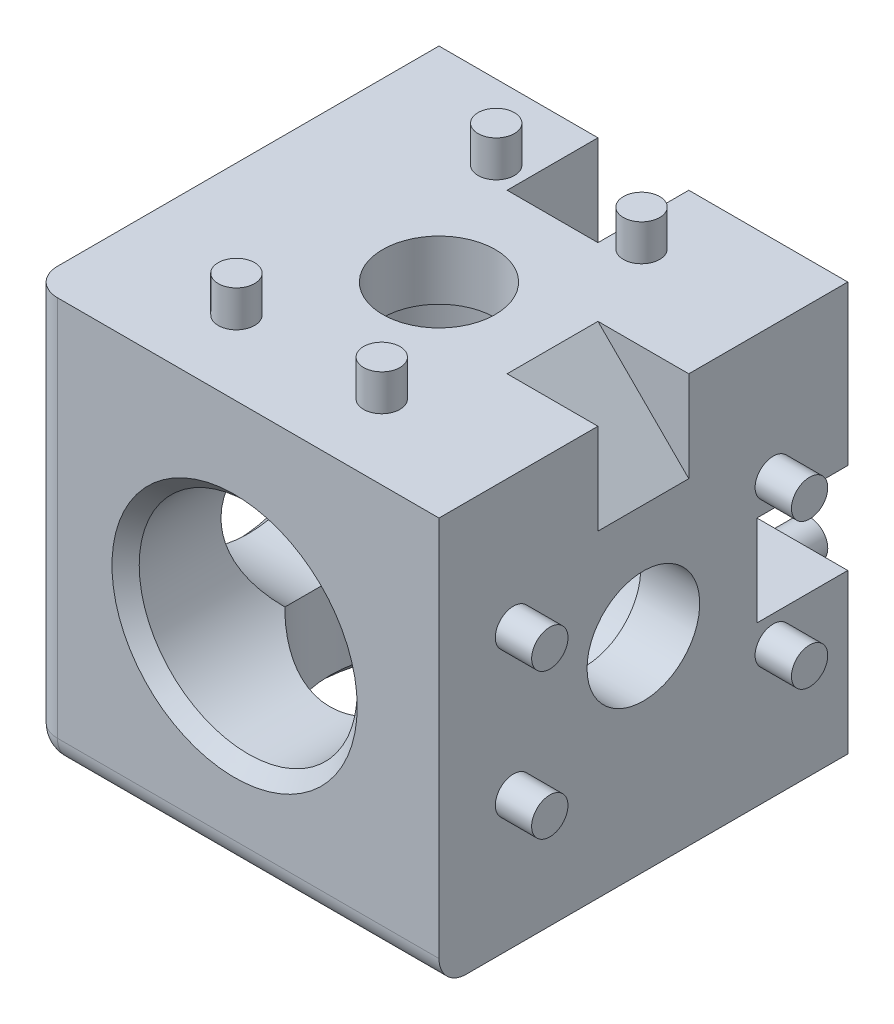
ISO-10303-21;
HEADER;
FILE_DESCRIPTION(('STEP AP214'),'2;1');
FILE_NAME('part.step','',(''),(''),'','','');
FILE_SCHEMA(('AUTOMOTIVE_DESIGN { 1 0 10303 214 1 1 1 1 }'));
ENDSEC;
DATA;
#1=APPLICATION_CONTEXT('core data for automotive mechanical design processes');
#2=APPLICATION_PROTOCOL_DEFINITION('international standard','automotive_design',2000,#1);
#3=PRODUCT_CONTEXT('',#1,'mechanical');
#4=PRODUCT('Part','Part','',(#3));
#5=PRODUCT_RELATED_PRODUCT_CATEGORY('part','',(#4));
#6=PRODUCT_DEFINITION_FORMATION('','',#4);
#7=PRODUCT_DEFINITION_CONTEXT('part definition',#1,'design');
#8=PRODUCT_DEFINITION('design','',#6,#7);
#9=PRODUCT_DEFINITION_SHAPE('','',#8);
#10=(LENGTH_UNIT() NAMED_UNIT(*) SI_UNIT(.MILLI.,.METRE.));
#11=(NAMED_UNIT(*) PLANE_ANGLE_UNIT() SI_UNIT($,.RADIAN.));
#12=(NAMED_UNIT(*) SI_UNIT($,.STERADIAN.) SOLID_ANGLE_UNIT());
#13=UNCERTAINTY_MEASURE_WITH_UNIT(LENGTH_MEASURE(1.E-05),#10,'distance_accuracy_value','');
#14=(GEOMETRIC_REPRESENTATION_CONTEXT(3) GLOBAL_UNCERTAINTY_ASSIGNED_CONTEXT((#13)) GLOBAL_UNIT_ASSIGNED_CONTEXT((#10,
#11,#12)) REPRESENTATION_CONTEXT('',''));
#15=CARTESIAN_POINT('',(0.,0.,0.));
#16=DIRECTION('',(0.,0.,1.));
#17=DIRECTION('',(1.,0.,0.));
#18=AXIS2_PLACEMENT_3D('',#15,#16,#17);
#19=CARTESIAN_POINT('',(0.,2.27373675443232E-13,22.5));
#20=DIRECTION('',(-1.,0.,0.));
#21=DIRECTION('',(0.,0.,1.));
#22=AXIS2_PLACEMENT_3D('',#19,#20,#21);
#23=CYLINDRICAL_SURFACE('',#22,12.);
#24=CARTESIAN_POINT('',(0.,1.13686837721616E-13,22.5));
#25=DIRECTION('',(-0.707106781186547,0.,-0.707106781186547));
#26=DIRECTION('',(-0.707106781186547,0.,0.707106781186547));
#27=AXIS2_PLACEMENT_3D('',#24,#25,#26);
#28=ELLIPSE('',#27,16.9705627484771,12.);
#29=CARTESIAN_POINT('',(-7.4246212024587,9.42735381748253,29.9246212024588));
#30=VERTEX_POINT('',#29);
#31=CARTESIAN_POINT('',(-8.48528137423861,-8.4852813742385,30.9852813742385));
#32=VERTEX_POINT('',#31);
#33=EDGE_CURVE('E144',#30,#32,#28,.F.);
#34=ORIENTED_EDGE('',*,*,#33,.T.);
#35=CARTESIAN_POINT('',(0.,2.27373675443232E-13,22.5));
#36=DIRECTION('',(-0.707106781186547,0.707106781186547,0.));
#37=DIRECTION('',(-0.707106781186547,-0.707106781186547,0.));
#38=AXIS2_PLACEMENT_3D('',#35,#36,#37);
#39=ELLIPSE('',#38,16.9705627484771,12.);
#40=CARTESIAN_POINT('',(-7.42462120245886,-7.42462120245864,13.0726461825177));
#41=VERTEX_POINT('',#40);
#42=EDGE_CURVE('E840',#32,#41,#39,.F.);
#43=ORIENTED_EDGE('',*,*,#42,.T.);
#44=CARTESIAN_POINT('',(-7.42462120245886,-7.42462120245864,13.0726461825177));
#45=CARTESIAN_POINT('',(-7.61079827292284,-7.23841326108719,12.9259825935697));
#46=CARTESIAN_POINT('',(-7.79111122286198,-7.04411957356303,12.7819183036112));
#47=CARTESIAN_POINT('',(-8.13902574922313,-6.63910872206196,12.5008490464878));
#48=CARTESIAN_POINT('',(-8.30660914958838,-6.42836891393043,12.363854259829));
#49=CARTESIAN_POINT('',(-8.62892492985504,-5.98886467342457,12.0980758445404));
#50=CARTESIAN_POINT('',(-8.78353514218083,-5.75996149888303,11.9693724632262));
#51=CARTESIAN_POINT('',(-9.07656182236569,-5.28616616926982,11.7237492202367));
#52=CARTESIAN_POINT('',(-9.214987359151,-5.04128308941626,11.606822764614));
#53=CARTESIAN_POINT('',(-9.45104465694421,-4.58065769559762,11.4063493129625));
#54=CARTESIAN_POINT('',(-9.55156781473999,-4.36737525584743,11.3205498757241));
#55=CARTESIAN_POINT('',(-9.73924701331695,-3.93108624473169,11.1597801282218));
#56=CARTESIAN_POINT('',(-9.82640575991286,-3.70808165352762,11.0848076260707));
#57=CARTESIAN_POINT('',(-9.98588848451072,-3.25417357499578,10.9472363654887));
#58=CARTESIAN_POINT('',(-10.0582701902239,-3.0233051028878,10.8845894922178));
#59=CARTESIAN_POINT('',(-10.1875026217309,-2.55421076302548,10.7725033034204));
#60=CARTESIAN_POINT('',(-10.2443576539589,-2.31598695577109,10.723060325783));
#61=CARTESIAN_POINT('',(-10.3610432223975,-1.73704388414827,10.6214447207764));
#62=CARTESIAN_POINT('',(-10.4129584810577,-1.39346022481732,10.5760986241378));
#63=CARTESIAN_POINT('',(-10.4824459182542,-0.699880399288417,10.5153689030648));
#64=CARTESIAN_POINT('',(-10.4999906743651,-0.349879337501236,10.5000092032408));
#65=CARTESIAN_POINT('',(-10.5000065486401,0.245691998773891,10.4999935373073));
#66=CARTESIAN_POINT('',(-10.4913661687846,0.491323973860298,10.5075565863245));
#67=CARTESIAN_POINT('',(-10.4569890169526,0.980550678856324,10.5376195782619));
#68=CARTESIAN_POINT('',(-10.4312481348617,1.22414490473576,10.5601231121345));
#69=CARTESIAN_POINT('',(-10.363134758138,1.70734620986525,10.6195838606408));
#70=CARTESIAN_POINT('',(-10.3207515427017,1.94695061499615,10.6565503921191));
#71=CARTESIAN_POINT('',(-10.2201277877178,2.42023112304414,10.7441334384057));
#72=CARTESIAN_POINT('',(-10.1618878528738,2.65390745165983,10.7947494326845));
#73=CARTESIAN_POINT('',(-10.0309459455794,3.11232750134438,10.9082435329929));
#74=CARTESIAN_POINT('',(-9.95834204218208,3.33712003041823,10.9710384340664));
#75=CARTESIAN_POINT('',(-9.79948447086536,3.77823600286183,11.1079731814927));
#76=CARTESIAN_POINT('',(-9.71323089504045,3.99455950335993,11.1821129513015));
#77=CARTESIAN_POINT('',(-9.52808784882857,4.41802946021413,11.3406019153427));
#78=CARTESIAN_POINT('',(-9.42918970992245,4.62516948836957,11.4249581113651));
#79=CARTESIAN_POINT('',(-9.21984326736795,5.02954796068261,11.6026403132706));
#80=CARTESIAN_POINT('',(-9.10939241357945,5.22678420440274,11.6959682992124));
#81=CARTESIAN_POINT('',(-8.83288413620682,5.68570031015,11.9282351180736));
#82=CARTESIAN_POINT('',(-8.66190923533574,5.94260291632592,12.0707941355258));
#83=CARTESIAN_POINT('',(-8.30193212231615,6.43593037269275,12.3677877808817));
#84=CARTESIAN_POINT('',(-8.1129312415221,6.67235673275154,12.5222215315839));
#85=CARTESIAN_POINT('',(-7.71872282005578,7.1246983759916,12.8400273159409));
#86=CARTESIAN_POINT('',(-7.51351612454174,7.34061472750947,13.0033988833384));
#87=CARTESIAN_POINT('',(-7.08829578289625,7.75200230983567,13.336137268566));
#88=CARTESIAN_POINT('',(-6.86829012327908,7.94748442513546,13.5055008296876));
#89=CARTESIAN_POINT('',(-6.5666274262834,8.19382003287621,13.7325489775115));
#90=CARTESIAN_POINT('',(-6.49121066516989,8.25369278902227,13.7889034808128));
#91=CARTESIAN_POINT('',(-6.33899904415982,8.37115965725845,13.901726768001));
#92=CARTESIAN_POINT('',(-6.26220692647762,8.42875769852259,13.9581951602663));
#93=CARTESIAN_POINT('',(-6.18465843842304,8.48528137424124,14.0147186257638));
#94=B_SPLINE_CURVE_WITH_KNOTS('',3,(#44,#45,#46,#47,#48,#49,#50,#51,#52,#53,#54,#55,#56,#57,#58,
#59,#60,#61,#62,#63,#64,#65,#66,#67,#68,#69,#70,#71,#72,#73,#74,#75,#76,#77,#78,#79,#80,#81,#82,
#83,#84,#85,#86,#87,#88,#89,#90,#91,#92,#93),.UNSPECIFIED.,.F.,.F.,(4,2,2,2,2,2,2,2,2,2,2,2,2,2,
2,2,2,2,2,2,2,2,2,2,4),(0.,0.90420453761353,1.80967678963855,2.72289316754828,3.63559535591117,
4.3876115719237,5.13947532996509,5.88834316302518,6.63700308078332,7.68527969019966,
8.73439232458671,9.47109939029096,10.2079835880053,10.9453432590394,11.6826748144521,
12.4151359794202,13.1475922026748,13.8805532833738,14.6136765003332,15.6319833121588,
16.6502149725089,17.6683935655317,18.6860270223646,19.0207205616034,19.3548081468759),.UNSPECIFIED.);
#95=CARTESIAN_POINT('',(-6.18465843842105,8.48528137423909,14.0147186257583));
#96=VERTEX_POINT('',#95);
#97=EDGE_CURVE('E147',#41,#96,#94,.T.);
#98=ORIENTED_EDGE('',*,*,#97,.T.);
#99=CARTESIAN_POINT('',(-7.42462120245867,9.42735381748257,29.9246212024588));
#100=CARTESIAN_POINT('',(-7.61086712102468,9.57407167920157,29.7383444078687));
#101=CARTESIAN_POINT('',(-7.79124470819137,9.71818837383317,29.5439757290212));
#102=CARTESIAN_POINT('',(-8.13927518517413,9.99935365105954,29.1388067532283));
#103=CARTESIAN_POINT('',(-8.30691013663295,10.1363921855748,28.927984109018));
#104=CARTESIAN_POINT('',(-8.6292020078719,10.4021543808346,28.4884610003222));
#105=CARTESIAN_POINT('',(-8.78374706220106,10.5308045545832,28.2596335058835));
#106=CARTESIAN_POINT('',(-9.07665782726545,10.7763318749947,27.7859962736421));
#107=CARTESIAN_POINT('',(-9.21503225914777,10.8932153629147,27.541195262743));
#108=CARTESIAN_POINT('',(-9.45097962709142,11.0935954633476,27.080784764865));
#109=CARTESIAN_POINT('',(-9.55144518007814,11.1793454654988,26.8676360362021));
#110=CARTESIAN_POINT('',(-9.73902565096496,11.3400298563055,26.4316250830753));
#111=CARTESIAN_POINT('',(-9.82614335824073,11.4149665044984,26.2087649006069));
#112=CARTESIAN_POINT('',(-9.98565059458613,11.5525579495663,25.7549137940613));
#113=CARTESIAN_POINT('',(-10.0580819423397,11.6152476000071,25.5239482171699));
#114=CARTESIAN_POINT('',(-10.1874180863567,11.7274230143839,25.0545577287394));
#115=CARTESIAN_POINT('',(-10.2443231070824,11.776908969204,24.8161329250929));
#116=CARTESIAN_POINT('',(-10.3419867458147,11.8619605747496,24.3316194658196));
#117=CARTESIAN_POINT('',(-10.3826210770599,11.897419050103,24.0854867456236));
#118=CARTESIAN_POINT('',(-10.4463457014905,11.9530706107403,23.5892362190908));
#119=CARTESIAN_POINT('',(-10.4694358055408,11.9732635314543,23.339118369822));
#120=CARTESIAN_POINT('',(-10.4976045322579,11.9979020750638,22.8369851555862));
#121=CARTESIAN_POINT('',(-10.5026754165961,12.002340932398,22.5849690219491));
#122=CARTESIAN_POINT('',(-10.4946751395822,11.9953408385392,22.0814599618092));
#123=CARTESIAN_POINT('',(-10.4816054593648,11.9839031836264,21.82996699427));
#124=CARTESIAN_POINT('',(-10.4399644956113,11.9475006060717,21.3565758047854));
#125=CARTESIAN_POINT('',(-10.4132030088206,11.9241153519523,21.1343922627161));
#126=CARTESIAN_POINT('',(-10.3458719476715,11.8653611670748,20.6937302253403));
#127=CARTESIAN_POINT('',(-10.3053018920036,11.8299918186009,20.4752518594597));
#128=CARTESIAN_POINT('',(-10.210991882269,11.747928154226,20.0434882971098));
#129=CARTESIAN_POINT('',(-10.1572601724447,11.7012409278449,19.8301999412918));
#130=CARTESIAN_POINT('',(-10.0373512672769,11.5973069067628,19.4097940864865));
#131=CARTESIAN_POINT('',(-9.97117339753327,11.5400595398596,19.2026769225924));
#132=CARTESIAN_POINT('',(-9.82392604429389,11.4130657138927,18.7863222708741));
#133=CARTESIAN_POINT('',(-9.7423189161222,11.3428714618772,18.5774116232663));
#134=CARTESIAN_POINT('',(-9.56734590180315,11.1929479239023,18.1680838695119));
#135=CARTESIAN_POINT('',(-9.47397570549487,11.1132151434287,17.9676699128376));
#136=CARTESIAN_POINT('',(-9.17719874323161,10.8609399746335,17.3792476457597));
#137=CARTESIAN_POINT('',(-8.95738852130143,10.6755492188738,17.0047891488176));
#138=CARTESIAN_POINT('',(-8.54268332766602,10.3304341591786,16.3866188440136));
#139=CARTESIAN_POINT('',(-8.35593192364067,10.176381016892,16.1340577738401));
#140=CARTESIAN_POINT('',(-7.96430416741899,9.85734320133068,15.650425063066));
#141=CARTESIAN_POINT('',(-7.75941426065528,9.69235037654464,15.4193697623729));
#142=CARTESIAN_POINT('',(-7.33465026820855,9.35576721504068,14.9803145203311));
#143=CARTESIAN_POINT('',(-7.11487684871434,9.18422407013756,14.7721806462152));
#144=CARTESIAN_POINT('',(-6.77416193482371,8.9237847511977,14.4760783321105));
#145=CARTESIAN_POINT('',(-6.65883236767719,8.83651301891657,14.3801221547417));
#146=CARTESIAN_POINT('',(-6.42449553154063,8.66130024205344,14.1934804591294));
#147=CARTESIAN_POINT('',(-6.30548855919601,8.57335925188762,14.1027945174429));
#148=CARTESIAN_POINT('',(-6.18465843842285,8.48528137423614,14.0147186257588));
#149=B_SPLINE_CURVE_WITH_KNOTS('',3,(#99,#100,#101,#102,#103,#104,#105,#106,#107,#108,#109,#110,
#111,#112,#113,#114,#115,#116,#117,#118,#119,#120,#121,#122,#123,#124,#125,#126,#127,#128,#129,
#130,#131,#132,#133,#134,#135,#136,#137,#138,#139,#140,#141,#142,#143,#144,#145,#146,#147,#148),
.UNSPECIFIED.,.F.,.F.,(4,2,2,2,2,2,2,2,2,2,2,2,2,2,2,2,2,2,2,2,2,2,2,2,4),(0.,0.904539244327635,
1.81032913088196,2.72320960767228,3.63559545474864,4.38715331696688,5.13855390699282,
5.88778390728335,6.63700307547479,7.39184085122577,8.14668676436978,8.90185680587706,
9.65696519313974,10.3312154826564,11.0054892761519,11.6793417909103,12.3532308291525,
13.0575605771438,13.762149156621,15.1737314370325,16.2220799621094,17.2712186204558,
18.3138593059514,18.8344517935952,19.3550023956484),.UNSPECIFIED.);
#150=EDGE_CURVE('E20',#30,#96,#149,.T.);
#151=ORIENTED_EDGE('',*,*,#150,.F.);
#152=EDGE_LOOP('',(#34,#43,#98,#151));
#153=FACE_BOUND('',#152,.T.);
#154=CARTESIAN_POINT('',(-21.,2.27248775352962E-13,22.5));
#155=DIRECTION('',(-1.,0.,0.));
#156=DIRECTION('',(0.,0.,1.));
#157=AXIS2_PLACEMENT_3D('',#154,#155,#156);
#158=CIRCLE('',#157,12.);
#159=CARTESIAN_POINT('',(-21.,2.27248775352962E-13,34.5));
#160=VERTEX_POINT('',#159);
#161=EDGE_CURVE('E501',#160,#160,#158,.T.);
#162=ORIENTED_EDGE('',*,*,#161,.T.);
#163=EDGE_LOOP('',(#162));
#164=FACE_BOUND('',#163,.T.);
#165=ADVANCED_FACE('F16',(#153,#164),#23,.F.);
#166=CARTESIAN_POINT('',(0.,16.0000000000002,22.5));
#167=DIRECTION('',(0.,-1.,0.));
#168=DIRECTION('',(0.,0.,-1.));
#169=AXIS2_PLACEMENT_3D('',#166,#167,#168);
#170=CYLINDRICAL_SURFACE('',#169,10.5);
#171=CARTESIAN_POINT('',(0.,16.0000000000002,22.5));
#172=DIRECTION('',(0.,-1.,0.));
#173=DIRECTION('',(0.,0.,-1.));
#174=AXIS2_PLACEMENT_3D('',#171,#172,#173);
#175=CIRCLE('',#174,10.5);
#176=CARTESIAN_POINT('',(0.,16.0000000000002,12.));
#177=VERTEX_POINT('',#176);
#178=EDGE_CURVE('E159',#177,#177,#175,.T.);
#179=ORIENTED_EDGE('',*,*,#178,.F.);
#180=EDGE_LOOP('',(#179));
#181=FACE_BOUND('',#180,.T.);
#182=ORIENTED_EDGE('',*,*,#150,.T.);
#183=CARTESIAN_POINT('',(0.,0.,22.5));
#184=DIRECTION('',(0.,0.707106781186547,0.707106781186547));
#185=DIRECTION('',(0.,-0.707106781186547,0.707106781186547));
#186=AXIS2_PLACEMENT_3D('',#183,#184,#185);
#187=ELLIPSE('',#186,14.8492424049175,10.5);
#188=CARTESIAN_POINT('',(7.42462120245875,7.42462120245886,15.0753787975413));
#189=VERTEX_POINT('',#188);
#190=EDGE_CURVE('E151',#189,#96,#187,.T.);
#191=ORIENTED_EDGE('',*,*,#190,.F.);
#192=CARTESIAN_POINT('',(0.,2.28178587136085E-13,22.5));
#193=DIRECTION('',(0.707106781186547,-0.707106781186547,0.));
#194=DIRECTION('',(-0.707106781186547,-0.707106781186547,0.));
#195=AXIS2_PLACEMENT_3D('',#192,#193,#194);
#196=ELLIPSE('',#195,14.8492424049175,10.5);
#197=CARTESIAN_POINT('',(8.48528137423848,8.48528137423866,28.6846584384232));
#198=VERTEX_POINT('',#197);
#199=EDGE_CURVE('E164',#189,#198,#196,.T.);
#200=ORIENTED_EDGE('',*,*,#199,.T.);
#201=CARTESIAN_POINT('',(8.48528137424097,8.48528137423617,28.6846584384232));
#202=CARTESIAN_POINT('',(8.39785569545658,8.57270858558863,28.8045961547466));
#203=CARTESIAN_POINT('',(8.30785931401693,8.66000066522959,28.9227369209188));
#204=CARTESIAN_POINT('',(8.12267358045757,8.83392939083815,29.1553970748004));
#205=CARTESIAN_POINT('',(8.02748376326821,8.92056597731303,29.2699161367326));
#206=CARTESIAN_POINT('',(7.73382827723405,9.17910479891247,29.6082474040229));
#207=CARTESIAN_POINT('',(7.52749333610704,9.34941714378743,29.8265358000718));
#208=CARTESIAN_POINT('',(7.09183081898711,9.68411557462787,30.2491190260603));
#209=CARTESIAN_POINT('',(6.86231595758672,9.84843589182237,30.4532729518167));
#210=CARTESIAN_POINT('',(6.38184550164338,10.1663633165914,30.843726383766));
#211=CARTESIAN_POINT('',(6.13090301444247,10.3199768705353,31.030036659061));
#212=CARTESIAN_POINT('',(5.66678318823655,10.5802422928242,31.342921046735));
#213=CARTESIAN_POINT('',(5.45784941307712,10.6896729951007,31.4734920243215));
#214=CARTESIAN_POINT('',(5.02755243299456,10.8986652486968,31.7214618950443));
#215=CARTESIAN_POINT('',(4.80618972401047,10.9982271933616,31.8388613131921));
#216=CARTESIAN_POINT('',(4.35229784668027,11.1855981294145,32.0588133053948));
#217=CARTESIAN_POINT('',(4.11980263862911,11.2734401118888,32.1614076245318));
#218=CARTESIAN_POINT('',(3.64400300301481,11.4361024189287,32.3507250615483));
#219=CARTESIAN_POINT('',(3.40069865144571,11.5109228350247,32.437448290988));
#220=CARTESIAN_POINT('',(2.90350388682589,11.6463013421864,32.593952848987));
#221=CARTESIAN_POINT('',(2.64957025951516,11.7067928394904,32.6636551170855));
#222=CARTESIAN_POINT('',(2.13399294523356,11.8116578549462,32.7842671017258));
#223=CARTESIAN_POINT('',(1.87234929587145,11.8560314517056,32.8351769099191));
#224=CARTESIAN_POINT('',(1.34365190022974,11.9275203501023,32.9171081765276));
#225=CARTESIAN_POINT('',(1.07659875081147,11.9546375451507,32.9481318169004));
#226=CARTESIAN_POINT('',(0.539690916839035,11.9908757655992,32.9895759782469));
#227=CARTESIAN_POINT('',(0.269836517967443,11.9999986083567,32.999998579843));
#228=CARTESIAN_POINT('',(-0.24582599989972,12.0000012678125,33.000001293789));
#229=CARTESIAN_POINT('',(-0.491637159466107,11.9924321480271,32.9913534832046));
#230=CARTESIAN_POINT('',(-0.98111804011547,11.9623375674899,32.9569398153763));
#231=CARTESIAN_POINT('',(-1.22478790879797,11.9398131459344,32.9311751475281));
#232=CARTESIAN_POINT('',(-1.70793189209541,11.8803286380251,32.8630344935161));
#233=CARTESIAN_POINT('',(-1.94740693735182,11.8433717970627,32.8206622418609));
#234=CARTESIAN_POINT('',(-2.42044817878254,11.7558197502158,32.7200739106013));
#235=CARTESIAN_POINT('',(-2.65401421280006,11.7052241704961,32.6618573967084));
#236=CARTESIAN_POINT('',(-3.11216789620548,11.5917959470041,32.5309914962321));
#237=CARTESIAN_POINT('',(-3.33680602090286,11.5290493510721,32.4584435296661));
#238=CARTESIAN_POINT('',(-3.77772969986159,11.3921936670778,32.2996783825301));
#239=CARTESIAN_POINT('',(-3.99401135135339,11.318079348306,32.2134549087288));
#240=CARTESIAN_POINT('',(-4.41755731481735,11.1595876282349,32.0283098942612));
#241=CARTESIAN_POINT('',(-4.62480824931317,11.0751956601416,31.9293703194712));
#242=CARTESIAN_POINT('',(-5.02938873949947,10.8974345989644,31.7199320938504));
#243=CARTESIAN_POINT('',(-5.22671712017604,10.8040644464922,31.6094320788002));
#244=CARTESIAN_POINT('',(-5.60651356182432,10.6118440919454,31.3805968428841));
#245=CARTESIAN_POINT('',(-5.7892222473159,10.5131749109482,31.262507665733));
#246=CARTESIAN_POINT('',(-6.14461841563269,10.3094917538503,31.0170596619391));
#247=CARTESIAN_POINT('',(-6.3173047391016,10.2044770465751,30.8896997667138));
#248=CARTESIAN_POINT('',(-6.65158776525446,9.98977531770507,30.6271954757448));
#249=CARTESIAN_POINT('',(-6.81324227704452,9.88011847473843,30.4920998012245));
#250=CARTESIAN_POINT('',(-7.12646647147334,9.65662946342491,30.2140938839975));
#251=CARTESIAN_POINT('',(-7.27804112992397,9.54279939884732,30.0711875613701));
#252=CARTESIAN_POINT('',(-7.42462120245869,9.42735381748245,29.9246212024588));
#253=B_SPLINE_CURVE_WITH_KNOTS('',3,(#201,#202,#203,#204,#205,#206,#207,#208,#209,#210,#211,
#212,#213,#214,#215,#216,#217,#218,#219,#220,#221,#222,#223,#224,#225,#226,#227,#228,#229,#230,
#231,#232,#233,#234,#235,#236,#237,#238,#239,#240,#241,#242,#243,#244,#245,#246,#247,#248,#249,
#250,#251,#252),.UNSPECIFIED.,.F.,.F.,(4,2,2,2,2,2,2,2,2,2,2,2,2,2,2,2,2,2,2,2,2,2,2,2,2,4),(0.,
0.51670479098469,1.03345592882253,2.06824068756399,3.11218121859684,4.15548768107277,
4.9635407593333,5.7715616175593,6.57725766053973,7.38294803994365,8.1923124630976,
9.00167293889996,9.81094459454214,10.6201345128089,11.3573213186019,12.0944569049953,
12.8314268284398,13.568416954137,14.3003672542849,15.0326553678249,15.765993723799,
16.4994187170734,17.2155579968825,17.9317799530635,18.6439030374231,19.3556719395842),.UNSPECIFIED.);
#254=EDGE_CURVE('E156',#198,#30,#253,.T.);
#255=ORIENTED_EDGE('',*,*,#254,.T.);
#256=EDGE_LOOP('',(#182,#191,#200,#255));
#257=FACE_BOUND('',#256,.T.);
#258=ADVANCED_FACE('F162',(#181,#257),#170,.F.);
#259=CARTESIAN_POINT('',(0.,0.,6.5));
#260=DIRECTION('',(0.,0.,1.));
#261=DIRECTION('',(1.,0.,0.));
#262=AXIS2_PLACEMENT_3D('',#259,#260,#261);
#263=CYLINDRICAL_SURFACE('',#262,10.5);
#264=CARTESIAN_POINT('',(0.,1.13686837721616E-13,22.5));
#265=DIRECTION('',(0.707106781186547,0.,0.707106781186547));
#266=DIRECTION('',(-0.707106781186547,0.,0.707106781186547));
#267=AXIS2_PLACEMENT_3D('',#264,#265,#266);
#268=ELLIPSE('',#267,14.8492424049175,10.5);
#269=CARTESIAN_POINT('',(8.48528137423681,-6.18465843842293,14.0147186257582));
#270=VERTEX_POINT('',#269);
#271=EDGE_CURVE('E489',#270,#189,#268,.T.);
#272=ORIENTED_EDGE('',*,*,#271,.T.);
#273=ORIENTED_EDGE('',*,*,#190,.T.);
#274=ORIENTED_EDGE('',*,*,#97,.F.);
#275=CARTESIAN_POINT('',(-7.42462120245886,-7.42462120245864,13.0726461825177));
#276=CARTESIAN_POINT('',(-7.23841326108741,-7.61079827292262,12.9259825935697));
#277=CARTESIAN_POINT('',(-7.04411957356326,-7.79111122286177,12.7819183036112));
#278=CARTESIAN_POINT('',(-6.63910872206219,-8.13902574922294,12.5008490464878));
#279=CARTESIAN_POINT('',(-6.42836891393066,-8.30660914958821,12.363854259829));
#280=CARTESIAN_POINT('',(-5.9888646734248,-8.62892492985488,12.0980758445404));
#281=CARTESIAN_POINT('',(-5.75996149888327,-8.78353514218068,11.9693724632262));
#282=CARTESIAN_POINT('',(-5.28616616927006,-9.07656182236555,11.7237492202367));
#283=CARTESIAN_POINT('',(-5.0412830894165,-9.21498735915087,11.606822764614));
#284=CARTESIAN_POINT('',(-4.58065769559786,-9.4510446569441,11.4063493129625));
#285=CARTESIAN_POINT('',(-4.36737525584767,-9.55156781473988,11.3205498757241));
#286=CARTESIAN_POINT('',(-3.93108624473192,-9.73924701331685,11.1597801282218));
#287=CARTESIAN_POINT('',(-3.70808165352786,-9.82640575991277,11.0848076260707));
#288=CARTESIAN_POINT('',(-3.25417357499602,-9.98588848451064,10.9472363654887));
#289=CARTESIAN_POINT('',(-3.02330510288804,-10.0582701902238,10.8845894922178));
#290=CARTESIAN_POINT('',(-2.55421076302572,-10.1875026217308,10.7725033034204));
#291=CARTESIAN_POINT('',(-2.31598695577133,-10.2443576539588,10.723060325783));
#292=CARTESIAN_POINT('',(-1.7370438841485,-10.3610432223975,10.6214447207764));
#293=CARTESIAN_POINT('',(-1.39346022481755,-10.4129584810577,10.5760986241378));
#294=CARTESIAN_POINT('',(-0.699880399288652,-10.4824459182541,10.5153689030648));
#295=CARTESIAN_POINT('',(-0.349879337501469,-10.4999906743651,10.5000092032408));
#296=CARTESIAN_POINT('',(0.245691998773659,-10.5000065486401,10.4999935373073));
#297=CARTESIAN_POINT('',(0.491323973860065,-10.4913661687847,10.5075565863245));
#298=CARTESIAN_POINT('',(0.980550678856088,-10.4569890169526,10.5376195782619));
#299=CARTESIAN_POINT('',(1.22414490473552,-10.4312481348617,10.5601231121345));
#300=CARTESIAN_POINT('',(1.70734620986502,-10.3631347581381,10.6195838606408));
#301=CARTESIAN_POINT('',(1.94695061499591,-10.3207515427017,10.6565503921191));
#302=CARTESIAN_POINT('',(2.4202311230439,-10.2201277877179,10.7441334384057));
#303=CARTESIAN_POINT('',(2.65390745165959,-10.1618878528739,10.7947494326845));
#304=CARTESIAN_POINT('',(3.11232750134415,-10.0309459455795,10.9082435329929));
#305=CARTESIAN_POINT('',(3.337120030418,-9.95834204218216,10.9710384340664));
#306=CARTESIAN_POINT('',(3.77823600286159,-9.79948447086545,11.1079731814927));
#307=CARTESIAN_POINT('',(3.99455950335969,-9.71323089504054,11.1821129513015));
#308=CARTESIAN_POINT('',(4.41802946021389,-9.52808784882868,11.3406019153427));
#309=CARTESIAN_POINT('',(4.62516948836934,-9.42918970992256,11.4249581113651));
#310=CARTESIAN_POINT('',(5.02954796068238,-9.21984326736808,11.6026403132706));
#311=CARTESIAN_POINT('',(5.22678420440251,-9.10939241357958,11.6959682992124));
#312=CARTESIAN_POINT('',(5.68570031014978,-8.83288413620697,11.9282351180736));
#313=CARTESIAN_POINT('',(5.9426029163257,-8.66190923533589,12.0707941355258));
#314=CARTESIAN_POINT('',(6.43593037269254,-8.30193212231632,12.3677877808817));
#315=CARTESIAN_POINT('',(6.67235673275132,-8.11293124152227,12.5222215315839));
#316=CARTESIAN_POINT('',(7.12469837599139,-7.71872282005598,12.8400273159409));
#317=CARTESIAN_POINT('',(7.34061472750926,-7.51351612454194,13.0033988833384));
#318=CARTESIAN_POINT('',(7.75200230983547,-7.08829578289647,13.336137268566));
#319=CARTESIAN_POINT('',(7.94748442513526,-6.86829012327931,13.5055008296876));
#320=CARTESIAN_POINT('',(8.19382003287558,-6.56662742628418,13.7325489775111));
#321=CARTESIAN_POINT('',(8.25369278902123,-6.49121066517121,13.788903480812));
#322=CARTESIAN_POINT('',(8.3711596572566,-6.33899904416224,13.9017267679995));
#323=CARTESIAN_POINT('',(8.42875769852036,-6.26220692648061,13.9581951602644));
#324=CARTESIAN_POINT('',(8.48528137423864,-6.1846584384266,14.0147186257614));
#325=B_SPLINE_CURVE_WITH_KNOTS('',3,(#275,#276,#277,#278,#279,#280,#281,#282,#283,#284,#285,
#286,#287,#288,#289,#290,#291,#292,#293,#294,#295,#296,#297,#298,#299,#300,#301,#302,#303,#304,
#305,#306,#307,#308,#309,#310,#311,#312,#313,#314,#315,#316,#317,#318,#319,#320,#321,#322,#323,
#324),.UNSPECIFIED.,.F.,.F.,(4,2,2,2,2,2,2,2,2,2,2,2,2,2,2,2,2,2,2,2,2,2,2,2,4),(0.,
0.904204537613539,1.80967678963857,2.72289316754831,3.63559535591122,4.38761157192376,
5.13947532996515,5.88834316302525,6.63700308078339,7.68527969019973,8.73439232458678,
9.47109939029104,10.2079835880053,10.9453432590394,11.6826748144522,12.4151359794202,
13.1475922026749,13.8805532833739,14.6136765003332,15.6319833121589,16.6502149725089,
17.6683935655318,18.6860270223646,19.020720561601,19.3548081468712),.UNSPECIFIED.);
#326=EDGE_CURVE('E166',#41,#270,#325,.T.);
#327=ORIENTED_EDGE('',*,*,#326,.T.);
#328=EDGE_LOOP('',(#272,#273,#274,#327));
#329=FACE_BOUND('',#328,.T.);
#330=CARTESIAN_POINT('',(0.,0.,6.5));
#331=DIRECTION('',(0.,0.,1.));
#332=DIRECTION('',(1.,0.,0.));
#333=AXIS2_PLACEMENT_3D('',#330,#331,#332);
#334=CIRCLE('',#333,10.5);
#335=CARTESIAN_POINT('',(10.5,0.,6.5));
#336=VERTEX_POINT('',#335);
#337=EDGE_CURVE('E503',#336,#336,#334,.T.);
#338=ORIENTED_EDGE('',*,*,#337,.F.);
#339=EDGE_LOOP('',(#338));
#340=FACE_BOUND('',#339,.T.);
#341=ADVANCED_FACE('F825',(#329,#340),#263,.F.);
#342=CARTESIAN_POINT('',(0.,2.27373675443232E-13,22.5));
#343=DIRECTION('',(0.,-1.,0.));
#344=DIRECTION('',(0.,0.,-1.));
#345=AXIS2_PLACEMENT_3D('',#342,#343,#344);
#346=CYLINDRICAL_SURFACE('',#345,12.);
#347=ORIENTED_EDGE('',*,*,#326,.F.);
#348=ORIENTED_EDGE('',*,*,#42,.F.);
#349=CARTESIAN_POINT('',(0.,0.,22.5));
#350=DIRECTION('',(0.,-0.707106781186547,-0.707106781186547));
#351=DIRECTION('',(0.,-0.707106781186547,0.707106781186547));
#352=AXIS2_PLACEMENT_3D('',#349,#350,#351);
#353=ELLIPSE('',#352,16.9705627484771,12.);
#354=CARTESIAN_POINT('',(9.4273538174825,-7.42462120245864,29.9246212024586));
#355=VERTEX_POINT('',#354);
#356=EDGE_CURVE('E158',#32,#355,#353,.F.);
#357=ORIENTED_EDGE('',*,*,#356,.T.);
#358=CARTESIAN_POINT('',(9.4273538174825,-7.42462120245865,29.9246212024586));
#359=CARTESIAN_POINT('',(9.5740716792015,-7.61086712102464,29.7383444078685));
#360=CARTESIAN_POINT('',(9.71818837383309,-7.79124470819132,29.543975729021));
#361=CARTESIAN_POINT('',(9.99935365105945,-8.13927518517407,29.1388067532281));
#362=CARTESIAN_POINT('',(10.1363921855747,-8.30691013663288,28.9279841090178));
#363=CARTESIAN_POINT('',(10.4021543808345,-8.62920200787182,28.488461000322));
#364=CARTESIAN_POINT('',(10.5308045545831,-8.78374706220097,28.2596335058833));
#365=CARTESIAN_POINT('',(10.7763318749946,-9.07665782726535,27.7859962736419));
#366=CARTESIAN_POINT('',(10.8932153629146,-9.21503225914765,27.5411952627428));
#367=CARTESIAN_POINT('',(11.0935954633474,-9.45097962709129,27.0807847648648));
#368=CARTESIAN_POINT('',(11.1793454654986,-9.55144518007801,26.8676360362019));
#369=CARTESIAN_POINT('',(11.3400298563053,-9.73902565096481,26.4316250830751));
#370=CARTESIAN_POINT('',(11.4149665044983,-9.82614335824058,26.2087649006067));
#371=CARTESIAN_POINT('',(11.5525579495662,-9.98565059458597,25.7549137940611));
#372=CARTESIAN_POINT('',(11.6152476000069,-10.0580819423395,25.5239482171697));
#373=CARTESIAN_POINT('',(11.7274230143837,-10.1874180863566,25.0545577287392));
#374=CARTESIAN_POINT('',(11.7769089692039,-10.2443231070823,24.8161329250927));
#375=CARTESIAN_POINT('',(11.8619605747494,-10.3419867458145,24.3316194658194));
#376=CARTESIAN_POINT('',(11.8974190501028,-10.3826210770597,24.0854867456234));
#377=CARTESIAN_POINT('',(11.9530706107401,-10.4463457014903,23.5892362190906));
#378=CARTESIAN_POINT('',(11.9732635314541,-10.4694358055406,23.3391183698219));
#379=CARTESIAN_POINT('',(11.9979020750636,-10.4976045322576,22.836985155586));
#380=CARTESIAN_POINT('',(12.0023409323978,-10.5026754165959,22.5849690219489));
#381=CARTESIAN_POINT('',(11.995340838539,-10.4946751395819,22.081459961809));
#382=CARTESIAN_POINT('',(11.9839031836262,-10.4816054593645,21.8299669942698));
#383=CARTESIAN_POINT('',(11.9475006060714,-10.439964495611,21.3565758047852));
#384=CARTESIAN_POINT('',(11.9241153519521,-10.4132030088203,21.1343922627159));
#385=CARTESIAN_POINT('',(11.8653611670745,-10.3458719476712,20.6937302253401));
#386=CARTESIAN_POINT('',(11.8299918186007,-10.3053018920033,20.4752518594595));
#387=CARTESIAN_POINT('',(11.7479281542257,-10.2109918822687,20.0434882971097));
#388=CARTESIAN_POINT('',(11.7012409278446,-10.1572601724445,19.8301999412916));
#389=CARTESIAN_POINT('',(11.5973069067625,-10.0373512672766,19.4097940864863));
#390=CARTESIAN_POINT('',(11.5400595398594,-9.97117339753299,19.2026769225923));
#391=CARTESIAN_POINT('',(11.4130657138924,-9.82392604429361,18.786322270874));
#392=CARTESIAN_POINT('',(11.3428714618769,-9.74231891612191,18.5774116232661));
#393=CARTESIAN_POINT('',(11.192947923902,-9.56734590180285,18.1680838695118));
#394=CARTESIAN_POINT('',(11.1132151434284,-9.47397570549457,17.9676699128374));
#395=CARTESIAN_POINT('',(10.8609399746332,-9.1771987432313,17.3792476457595));
#396=CARTESIAN_POINT('',(10.6755492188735,-8.95738852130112,17.0047891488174));
#397=CARTESIAN_POINT('',(10.3304341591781,-8.5426833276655,16.3866188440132));
#398=CARTESIAN_POINT('',(10.1763810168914,-8.35593192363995,16.1340577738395));
#399=CARTESIAN_POINT('',(9.85734320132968,-7.9643041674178,15.6504250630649));
#400=CARTESIAN_POINT('',(9.69235037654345,-7.75941426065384,15.4193697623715));
#401=CARTESIAN_POINT('',(9.35576721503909,-7.33465026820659,14.9803145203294));
#402=CARTESIAN_POINT('',(9.18422407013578,-7.11487684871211,14.7721806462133));
#403=CARTESIAN_POINT('',(8.92378475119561,-6.77416193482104,14.4760783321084));
#404=CARTESIAN_POINT('',(8.83651301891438,-6.65883236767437,14.3801221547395));
#405=CARTESIAN_POINT('',(8.66130024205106,-6.42449553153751,14.1934804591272));
#406=CARTESIAN_POINT('',(8.57335925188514,-6.30548855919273,14.1027945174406));
#407=CARTESIAN_POINT('',(8.48528137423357,-6.18465843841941,14.0147186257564));
#408=B_SPLINE_CURVE_WITH_KNOTS('',3,(#358,#359,#360,#361,#362,#363,#364,#365,#366,#367,#368,
#369,#370,#371,#372,#373,#374,#375,#376,#377,#378,#379,#380,#381,#382,#383,#384,#385,#386,#387,
#388,#389,#390,#391,#392,#393,#394,#395,#396,#397,#398,#399,#400,#401,#402,#403,#404,#405,#406,
#407),.UNSPECIFIED.,.F.,.F.,(4,2,2,2,2,2,2,2,2,2,2,2,2,2,2,2,2,2,2,2,2,2,2,2,4),(0.,
0.904539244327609,1.81032913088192,2.72320960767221,3.63559545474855,4.38715331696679,
5.13855390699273,5.88778390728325,6.63700307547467,7.39184085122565,8.14668676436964,
8.90185680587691,9.65696519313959,10.3312154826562,11.0054892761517,11.6793417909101,
12.3532308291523,13.0575605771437,13.7621491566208,15.1737314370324,16.2220799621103,
17.2712186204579,18.3138593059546,18.8344517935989,19.3550023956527),.UNSPECIFIED.);
#409=EDGE_CURVE('E195',#355,#270,#408,.T.);
#410=ORIENTED_EDGE('',*,*,#409,.T.);
#411=EDGE_LOOP('',(#347,#348,#357,#410));
#412=FACE_BOUND('',#411,.T.);
#413=CARTESIAN_POINT('',(0.,-20.9999999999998,22.5));
#414=DIRECTION('',(0.,-1.,0.));
#415=DIRECTION('',(0.,0.,-1.));
#416=AXIS2_PLACEMENT_3D('',#413,#414,#415);
#417=CIRCLE('',#416,12.);
#418=CARTESIAN_POINT('',(0.,-20.9999999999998,10.5));
#419=VERTEX_POINT('',#418);
#420=EDGE_CURVE('E490',#419,#419,#417,.T.);
#421=ORIENTED_EDGE('',*,*,#420,.T.);
#422=EDGE_LOOP('',(#421));
#423=FACE_BOUND('',#422,.T.);
#424=ADVANCED_FACE('F182',(#412,#423),#346,.F.);
#425=CARTESIAN_POINT('',(0.,0.,22.5));
#426=DIRECTION('',(0.,0.,1.));
#427=DIRECTION('',(1.,0.,0.));
#428=AXIS2_PLACEMENT_3D('',#425,#426,#427);
#429=CYLINDRICAL_SURFACE('',#428,12.);
#430=ORIENTED_EDGE('',*,*,#254,.F.);
#431=CARTESIAN_POINT('',(8.485281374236,8.48528137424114,28.6846584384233));
#432=CARTESIAN_POINT('',(8.57270858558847,8.39785569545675,28.8045961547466));
#433=CARTESIAN_POINT('',(8.66000066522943,8.30785931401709,28.9227369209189));
#434=CARTESIAN_POINT('',(8.833929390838,8.12267358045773,29.1553970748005));
#435=CARTESIAN_POINT('',(8.92056597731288,8.02748376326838,29.2699161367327));
#436=CARTESIAN_POINT('',(9.17910479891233,7.73382827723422,29.608247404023));
#437=CARTESIAN_POINT('',(9.3494171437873,7.5274933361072,29.8265358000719));
#438=CARTESIAN_POINT('',(9.68411557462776,7.09183081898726,30.2491190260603));
#439=CARTESIAN_POINT('',(9.84843589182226,6.86231595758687,30.4532729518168));
#440=CARTESIAN_POINT('',(10.1663633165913,6.38184550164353,30.843726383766));
#441=CARTESIAN_POINT('',(10.3199768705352,6.13090301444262,31.030036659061));
#442=CARTESIAN_POINT('',(10.5802422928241,5.66678318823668,31.342921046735));
#443=CARTESIAN_POINT('',(10.6896729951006,5.45784941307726,31.4734920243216));
#444=CARTESIAN_POINT('',(10.8986652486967,5.0275524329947,31.7214618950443));
#445=CARTESIAN_POINT('',(10.9982271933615,4.80618972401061,31.8388613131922));
#446=CARTESIAN_POINT('',(11.1855981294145,4.35229784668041,32.0588133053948));
#447=CARTESIAN_POINT('',(11.2734401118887,4.11980263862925,32.1614076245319));
#448=CARTESIAN_POINT('',(11.4361024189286,3.64400300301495,32.3507250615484));
#449=CARTESIAN_POINT('',(11.5109228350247,3.40069865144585,32.4374482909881));
#450=CARTESIAN_POINT('',(11.6463013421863,2.90350388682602,32.593952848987));
#451=CARTESIAN_POINT('',(11.7067928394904,2.64957025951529,32.6636551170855));
#452=CARTESIAN_POINT('',(11.8116578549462,2.13399294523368,32.7842671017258));
#453=CARTESIAN_POINT('',(11.8560314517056,1.87234929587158,32.8351769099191));
#454=CARTESIAN_POINT('',(11.9275203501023,1.34365190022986,32.9171081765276));
#455=CARTESIAN_POINT('',(11.9546375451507,1.07659875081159,32.9481318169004));
#456=CARTESIAN_POINT('',(11.9908757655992,0.539690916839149,32.9895759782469));
#457=CARTESIAN_POINT('',(11.9999986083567,0.269836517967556,32.999998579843));
#458=CARTESIAN_POINT('',(12.0000012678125,-0.245825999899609,33.000001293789));
#459=CARTESIAN_POINT('',(11.9924321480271,-0.491637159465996,32.9913534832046));
#460=CARTESIAN_POINT('',(11.96233756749,-0.981118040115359,32.9569398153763));
#461=CARTESIAN_POINT('',(11.9398131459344,-1.22478790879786,32.9311751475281));
#462=CARTESIAN_POINT('',(11.8803286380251,-1.7079318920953,32.8630344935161));
#463=CARTESIAN_POINT('',(11.8433717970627,-1.94740693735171,32.8206622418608));
#464=CARTESIAN_POINT('',(11.7558197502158,-2.42044817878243,32.7200739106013));
#465=CARTESIAN_POINT('',(11.7052241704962,-2.65401421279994,32.6618573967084));
#466=CARTESIAN_POINT('',(11.5917959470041,-3.11216789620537,32.5309914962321));
#467=CARTESIAN_POINT('',(11.5290493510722,-3.33680602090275,32.458443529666));
#468=CARTESIAN_POINT('',(11.3921936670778,-3.77772969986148,32.2996783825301));
#469=CARTESIAN_POINT('',(11.3180793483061,-3.99401135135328,32.2134549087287));
#470=CARTESIAN_POINT('',(11.159587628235,-4.41755731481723,32.0283098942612));
#471=CARTESIAN_POINT('',(11.0751956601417,-4.62480824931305,31.9293703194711));
#472=CARTESIAN_POINT('',(10.8974345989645,-5.02938873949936,31.7199320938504));
#473=CARTESIAN_POINT('',(10.8040644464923,-5.22671712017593,31.6094320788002));
#474=CARTESIAN_POINT('',(10.6118440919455,-5.60651356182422,31.380596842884));
#475=CARTESIAN_POINT('',(10.5131749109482,-5.7892222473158,31.262507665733));
#476=CARTESIAN_POINT('',(10.3094917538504,-6.14461841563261,31.017059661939));
#477=CARTESIAN_POINT('',(10.2044770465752,-6.31730473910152,30.8896997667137));
#478=CARTESIAN_POINT('',(9.98977531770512,-6.6515877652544,30.6271954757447));
#479=CARTESIAN_POINT('',(9.88011847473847,-6.81324227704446,30.4920998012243));
#480=CARTESIAN_POINT('',(9.65662946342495,-7.12646647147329,30.2140938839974));
#481=CARTESIAN_POINT('',(9.54279939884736,-7.27804112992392,30.0711875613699));
#482=CARTESIAN_POINT('',(9.42735381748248,-7.42462120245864,29.9246212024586));
#483=B_SPLINE_CURVE_WITH_KNOTS('',3,(#431,#432,#433,#434,#435,#436,#437,#438,#439,#440,#441,
#442,#443,#444,#445,#446,#447,#448,#449,#450,#451,#452,#453,#454,#455,#456,#457,#458,#459,#460,
#461,#462,#463,#464,#465,#466,#467,#468,#469,#470,#471,#472,#473,#474,#475,#476,#477,#478,#479,
#480,#481,#482),.UNSPECIFIED.,.F.,.F.,(4,2,2,2,2,2,2,2,2,2,2,2,2,2,2,2,2,2,2,2,2,2,2,2,2,4),(0.,
0.516704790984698,1.03345592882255,2.06824068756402,3.11218121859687,4.15548768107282,
4.96354075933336,5.77156161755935,6.57725766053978,7.3829480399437,8.19231246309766,
9.00167293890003,9.81094459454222,10.620134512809,11.3573213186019,12.0944569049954,
12.8314268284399,13.5684169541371,14.300367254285,15.032655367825,15.765993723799,
16.4994187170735,17.2155579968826,17.9317799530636,18.6439030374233,19.3556719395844),.UNSPECIFIED.);
#484=EDGE_CURVE('E187',#198,#355,#483,.T.);
#485=ORIENTED_EDGE('',*,*,#484,.T.);
#486=ORIENTED_EDGE('',*,*,#356,.F.);
#487=ORIENTED_EDGE('',*,*,#33,.F.);
#488=EDGE_LOOP('',(#430,#485,#486,#487));
#489=FACE_BOUND('',#488,.T.);
#490=CARTESIAN_POINT('',(0.,0.,43.5));
#491=DIRECTION('',(0.,0.,1.));
#492=DIRECTION('',(1.,0.,0.));
#493=AXIS2_PLACEMENT_3D('',#490,#491,#492);
#494=CIRCLE('',#493,12.);
#495=CARTESIAN_POINT('',(12.,0.,43.5));
#496=VERTEX_POINT('',#495);
#497=EDGE_CURVE('E420',#496,#496,#494,.T.);
#498=ORIENTED_EDGE('',*,*,#497,.T.);
#499=EDGE_LOOP('',(#498));
#500=FACE_BOUND('',#499,.T.);
#501=ADVANCED_FACE('F153',(#489,#500),#429,.F.);
#502=CARTESIAN_POINT('',(0.,16.0000000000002,22.5));
#503=DIRECTION('',(0.,-1.,0.));
#504=DIRECTION('',(0.,0.,-1.));
#505=AXIS2_PLACEMENT_3D('',#502,#503,#504);
#506=PLANE('',#505);
#507=ORIENTED_EDGE('',*,*,#178,.T.);
#508=EDGE_LOOP('',(#507));
#509=FACE_BOUND('',#508,.T.);
#510=CARTESIAN_POINT('',(0.,16.0000000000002,22.5));
#511=DIRECTION('',(0.,-1.,0.));
#512=DIRECTION('',(0.,0.,-1.));
#513=AXIS2_PLACEMENT_3D('',#510,#511,#512);
#514=CIRCLE('',#513,6.2);
#515=CARTESIAN_POINT('',(0.,16.0000000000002,16.3));
#516=VERTEX_POINT('',#515);
#517=EDGE_CURVE('E487',#516,#516,#514,.F.);
#518=ORIENTED_EDGE('',*,*,#517,.T.);
#519=EDGE_LOOP('',(#518));
#520=FACE_BOUND('',#519,.T.);
#521=ADVANCED_FACE('F181',(#509,#520),#506,.T.);
#522=CARTESIAN_POINT('',(-7.99999999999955,26.5000000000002,36.8000000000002));
#523=DIRECTION('',(0.,1.,0.));
#524=DIRECTION('',(0.,0.,1.));
#525=AXIS2_PLACEMENT_3D('',#522,#523,#524);
#526=PLANE('',#525);
#527=CARTESIAN_POINT('',(-7.99999999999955,26.5000000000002,36.8000000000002));
#528=DIRECTION('',(0.,1.,0.));
#529=DIRECTION('',(-1.,0.,0.));
#530=AXIS2_PLACEMENT_3D('',#527,#528,#529);
#531=CIRCLE('',#530,2.);
#532=CARTESIAN_POINT('',(-9.99999999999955,26.5000000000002,36.8000000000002));
#533=VERTEX_POINT('',#532);
#534=EDGE_CURVE('E482',#533,#533,#531,.F.);
#535=ORIENTED_EDGE('',*,*,#534,.F.);
#536=EDGE_LOOP('',(#535));
#537=FACE_BOUND('',#536,.T.);
#538=ADVANCED_FACE('F245',(#537),#526,.T.);
#539=CARTESIAN_POINT('',(-7.99999999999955,26.5000000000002,8.20000000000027));
#540=DIRECTION('',(0.,1.,0.));
#541=DIRECTION('',(0.,0.,1.));
#542=AXIS2_PLACEMENT_3D('',#539,#540,#541);
#543=PLANE('',#542);
#544=CARTESIAN_POINT('',(-7.99999999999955,26.5000000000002,8.20000000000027));
#545=DIRECTION('',(0.,1.,0.));
#546=DIRECTION('',(-1.,0.,0.));
#547=AXIS2_PLACEMENT_3D('',#544,#545,#546);
#548=CIRCLE('',#547,2.);
#549=CARTESIAN_POINT('',(-9.99999999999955,26.5000000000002,8.20000000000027));
#550=VERTEX_POINT('',#549);
#551=EDGE_CURVE('E479',#550,#550,#548,.F.);
#552=ORIENTED_EDGE('',*,*,#551,.F.);
#553=EDGE_LOOP('',(#552));
#554=FACE_BOUND('',#553,.T.);
#555=ADVANCED_FACE('F242',(#554),#543,.T.);
#556=CARTESIAN_POINT('',(8.00000000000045,26.5000000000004,8.20000000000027));
#557=DIRECTION('',(0.,1.,0.));
#558=DIRECTION('',(0.,0.,1.));
#559=AXIS2_PLACEMENT_3D('',#556,#557,#558);
#560=PLANE('',#559);
#561=CARTESIAN_POINT('',(8.00000000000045,26.5000000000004,8.20000000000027));
#562=DIRECTION('',(0.,1.,0.));
#563=DIRECTION('',(-1.,0.,0.));
#564=AXIS2_PLACEMENT_3D('',#561,#562,#563);
#565=CIRCLE('',#564,2.);
#566=CARTESIAN_POINT('',(6.00000000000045,26.5000000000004,8.20000000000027));
#567=VERTEX_POINT('',#566);
#568=EDGE_CURVE('E476',#567,#567,#565,.F.);
#569=ORIENTED_EDGE('',*,*,#568,.F.);
#570=EDGE_LOOP('',(#569));
#571=FACE_BOUND('',#570,.T.);
#572=ADVANCED_FACE('F238',(#571),#560,.T.);
#573=CARTESIAN_POINT('',(8.00000000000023,26.5000000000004,36.8000000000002));
#574=DIRECTION('',(0.,1.,0.));
#575=DIRECTION('',(0.,0.,1.));
#576=AXIS2_PLACEMENT_3D('',#573,#574,#575);
#577=PLANE('',#576);
#578=CARTESIAN_POINT('',(8.00000000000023,26.5000000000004,36.8000000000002));
#579=DIRECTION('',(0.,1.,0.));
#580=DIRECTION('',(-1.,0.,0.));
#581=AXIS2_PLACEMENT_3D('',#578,#579,#580);
#582=CIRCLE('',#581,2.);
#583=CARTESIAN_POINT('',(6.00000000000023,26.5000000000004,36.8000000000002));
#584=VERTEX_POINT('',#583);
#585=EDGE_CURVE('E473',#584,#584,#582,.F.);
#586=ORIENTED_EDGE('',*,*,#585,.F.);
#587=EDGE_LOOP('',(#586));
#588=FACE_BOUND('',#587,.T.);
#589=ADVANCED_FACE('F234',(#588),#577,.T.);
#590=CARTESIAN_POINT('',(0.,0.,6.5));
#591=DIRECTION('',(0.,0.,1.));
#592=DIRECTION('',(1.,0.,0.));
#593=AXIS2_PLACEMENT_3D('',#590,#591,#592);
#594=PLANE('',#593);
#595=ORIENTED_EDGE('',*,*,#337,.T.);
#596=EDGE_LOOP('',(#595));
#597=FACE_BOUND('',#596,.T.);
#598=CARTESIAN_POINT('',(0.,0.,6.5));
#599=DIRECTION('',(0.,0.,1.));
#600=DIRECTION('',(1.,0.,0.));
#601=AXIS2_PLACEMENT_3D('',#598,#599,#600);
#602=CIRCLE('',#601,6.2);
#603=CARTESIAN_POINT('',(6.2,0.,6.5));
#604=VERTEX_POINT('',#603);
#605=EDGE_CURVE('E469',#604,#604,#602,.F.);
#606=ORIENTED_EDGE('',*,*,#605,.T.);
#607=EDGE_LOOP('',(#606));
#608=FACE_BOUND('',#607,.T.);
#609=ADVANCED_FACE('F230',(#597,#608),#594,.T.);
#610=CARTESIAN_POINT('',(-22.5,2.27248775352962E-13,22.5));
#611=DIRECTION('',(-1.,0.,0.));
#612=DIRECTION('',(0.,-1.,0.));
#613=AXIS2_PLACEMENT_3D('',#610,#611,#612);
#614=CONICAL_SURFACE('',#613,13.5,0.785398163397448);
#615=ORIENTED_EDGE('',*,*,#161,.F.);
#616=EDGE_LOOP('',(#615));
#617=FACE_BOUND('',#616,.T.);
#618=CARTESIAN_POINT('',(-22.5,2.27248775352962E-13,22.5));
#619=DIRECTION('',(-1.,0.,0.));
#620=DIRECTION('',(0.,-1.,0.));
#621=AXIS2_PLACEMENT_3D('',#618,#619,#620);
#622=CIRCLE('',#621,13.5);
#623=CARTESIAN_POINT('',(-22.5,-13.4999999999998,22.5));
#624=VERTEX_POINT('',#623);
#625=EDGE_CURVE('E465',#624,#624,#622,.F.);
#626=ORIENTED_EDGE('',*,*,#625,.F.);
#627=EDGE_LOOP('',(#626));
#628=FACE_BOUND('',#627,.T.);
#629=ADVANCED_FACE('F226',(#617,#628),#614,.F.);
#630=CARTESIAN_POINT('',(14.3000000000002,-7.99999999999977,-4.));
#631=DIRECTION('',(0.,0.,1.));
#632=DIRECTION('',(1.,0.,0.));
#633=AXIS2_PLACEMENT_3D('',#630,#631,#632);
#634=PLANE('',#633);
#635=CARTESIAN_POINT('',(14.3000000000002,-7.99999999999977,-4.));
#636=DIRECTION('',(0.,0.,1.));
#637=DIRECTION('',(1.,0.,0.));
#638=AXIS2_PLACEMENT_3D('',#635,#636,#637);
#639=CIRCLE('',#638,2.);
#640=CARTESIAN_POINT('',(16.3000000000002,-7.99999999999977,-4.));
#641=VERTEX_POINT('',#640);
#642=EDGE_CURVE('E457',#641,#641,#639,.T.);
#643=ORIENTED_EDGE('',*,*,#642,.F.);
#644=EDGE_LOOP('',(#643));
#645=FACE_BOUND('',#644,.T.);
#646=ADVANCED_FACE('F222',(#645),#634,.F.);
#647=CARTESIAN_POINT('',(-14.2999999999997,-7.99999999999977,-4.));
#648=DIRECTION('',(0.,0.,1.));
#649=DIRECTION('',(1.,0.,0.));
#650=AXIS2_PLACEMENT_3D('',#647,#648,#649);
#651=PLANE('',#650);
#652=CARTESIAN_POINT('',(-14.2999999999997,-7.99999999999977,-4.));
#653=DIRECTION('',(0.,0.,1.));
#654=DIRECTION('',(1.,0.,0.));
#655=AXIS2_PLACEMENT_3D('',#652,#653,#654);
#656=CIRCLE('',#655,2.);
#657=CARTESIAN_POINT('',(-12.2999999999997,-7.99999999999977,-4.));
#658=VERTEX_POINT('',#657);
#659=EDGE_CURVE('E454',#658,#658,#656,.T.);
#660=ORIENTED_EDGE('',*,*,#659,.F.);
#661=EDGE_LOOP('',(#660));
#662=FACE_BOUND('',#661,.T.);
#663=ADVANCED_FACE('F218',(#662),#651,.F.);
#664=CARTESIAN_POINT('',(-14.2999999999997,8.00000000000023,-4.));
#665=DIRECTION('',(0.,0.,1.));
#666=DIRECTION('',(1.,0.,0.));
#667=AXIS2_PLACEMENT_3D('',#664,#665,#666);
#668=PLANE('',#667);
#669=CARTESIAN_POINT('',(-14.2999999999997,8.00000000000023,-4.));
#670=DIRECTION('',(0.,0.,1.));
#671=DIRECTION('',(1.,0.,0.));
#672=AXIS2_PLACEMENT_3D('',#669,#670,#671);
#673=CIRCLE('',#672,2.);
#674=CARTESIAN_POINT('',(-12.2999999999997,8.00000000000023,-4.));
#675=VERTEX_POINT('',#674);
#676=EDGE_CURVE('E451',#675,#675,#673,.T.);
#677=ORIENTED_EDGE('',*,*,#676,.F.);
#678=EDGE_LOOP('',(#677));
#679=FACE_BOUND('',#678,.T.);
#680=ADVANCED_FACE('F214',(#679),#668,.F.);
#681=CARTESIAN_POINT('',(14.3000000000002,8.,-4.));
#682=DIRECTION('',(0.,0.,1.));
#683=DIRECTION('',(1.,0.,0.));
#684=AXIS2_PLACEMENT_3D('',#681,#682,#683);
#685=PLANE('',#684);
#686=CARTESIAN_POINT('',(14.3000000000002,8.,-4.));
#687=DIRECTION('',(0.,0.,1.));
#688=DIRECTION('',(1.,0.,0.));
#689=AXIS2_PLACEMENT_3D('',#686,#687,#688);
#690=CIRCLE('',#689,2.);
#691=CARTESIAN_POINT('',(16.3000000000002,8.,-4.));
#692=VERTEX_POINT('',#691);
#693=EDGE_CURVE('E448',#692,#692,#690,.T.);
#694=ORIENTED_EDGE('',*,*,#693,.F.);
#695=EDGE_LOOP('',(#694));
#696=FACE_BOUND('',#695,.T.);
#697=ADVANCED_FACE('F208',(#696),#685,.F.);
#698=CARTESIAN_POINT('',(16.,2.27373675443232E-13,22.5));
#699=DIRECTION('',(-1.,0.,0.));
#700=DIRECTION('',(0.,0.,1.));
#701=AXIS2_PLACEMENT_3D('',#698,#699,#700);
#702=CYLINDRICAL_SURFACE('',#701,10.5);
#703=ORIENTED_EDGE('',*,*,#484,.F.);
#704=ORIENTED_EDGE('',*,*,#199,.F.);
#705=ORIENTED_EDGE('',*,*,#271,.F.);
#706=ORIENTED_EDGE('',*,*,#409,.F.);
#707=EDGE_LOOP('',(#703,#704,#705,#706));
#708=FACE_BOUND('',#707,.T.);
#709=CARTESIAN_POINT('',(16.,2.27373675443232E-13,22.5));
#710=DIRECTION('',(-1.,0.,0.));
#711=DIRECTION('',(0.,0.,1.));
#712=AXIS2_PLACEMENT_3D('',#709,#710,#711);
#713=CIRCLE('',#712,10.5);
#714=CARTESIAN_POINT('',(16.,2.27373675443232E-13,33.));
#715=VERTEX_POINT('',#714);
#716=EDGE_CURVE('E445',#715,#715,#713,.T.);
#717=ORIENTED_EDGE('',*,*,#716,.F.);
#718=EDGE_LOOP('',(#717));
#719=FACE_BOUND('',#718,.T.);
#720=ADVANCED_FACE('F202',(#708,#719),#702,.F.);
#721=CARTESIAN_POINT('',(0.,-22.4999999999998,22.5));
#722=DIRECTION('',(0.,-1.,0.));
#723=DIRECTION('',(0.,0.,-1.));
#724=AXIS2_PLACEMENT_3D('',#721,#722,#723);
#725=CONICAL_SURFACE('',#724,13.5,0.785398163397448);
#726=ORIENTED_EDGE('',*,*,#420,.F.);
#727=EDGE_LOOP('',(#726));
#728=FACE_BOUND('',#727,.T.);
#729=CARTESIAN_POINT('',(0.,-22.4999999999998,22.5));
#730=DIRECTION('',(0.,-1.,0.));
#731=DIRECTION('',(0.,0.,-1.));
#732=AXIS2_PLACEMENT_3D('',#729,#730,#731);
#733=CIRCLE('',#732,13.5);
#734=CARTESIAN_POINT('',(0.,-22.4999999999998,8.99999999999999));
#735=VERTEX_POINT('',#734);
#736=EDGE_CURVE('E441',#735,#735,#733,.T.);
#737=ORIENTED_EDGE('',*,*,#736,.T.);
#738=EDGE_LOOP('',(#737));
#739=FACE_BOUND('',#738,.T.);
#740=ADVANCED_FACE('F207',(#728,#739),#725,.F.);
#741=CARTESIAN_POINT('',(-19.5,-19.4999999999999,42.0000000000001));
#742=DIRECTION('',(0.120686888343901,0.987071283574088,0.105474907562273));
#743=DIRECTION('',(-0.992586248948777,0.121531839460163,-0.00159699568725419));
#744=AXIS2_PLACEMENT_3D('',#741,#742,#743);
#745=SPHERICAL_SURFACE('',#744,3.);
#746=CARTESIAN_POINT('',(-19.5,-19.4999999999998,42.));
#747=DIRECTION('',(0.,0.,1.));
#748=DIRECTION('',(1.,0.,0.));
#749=AXIS2_PLACEMENT_3D('',#746,#747,#748);
#750=CIRCLE('',#749,3.);
#751=CARTESIAN_POINT('',(-19.5,-22.4999999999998,42.));
#752=VERTEX_POINT('',#751);
#753=CARTESIAN_POINT('',(-22.5,-19.4999999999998,42.));
#754=VERTEX_POINT('',#753);
#755=EDGE_CURVE('E461',#752,#754,#750,.F.);
#756=ORIENTED_EDGE('',*,*,#755,.F.);
#757=CARTESIAN_POINT('',(-19.5,-19.4999999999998,42.));
#758=DIRECTION('',(1.,0.,0.));
#759=DIRECTION('',(0.,0.,-1.));
#760=AXIS2_PLACEMENT_3D('',#757,#758,#759);
#761=CIRCLE('',#760,3.);
#762=CARTESIAN_POINT('',(-19.5,-19.4999999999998,45.));
#763=VERTEX_POINT('',#762);
#764=EDGE_CURVE('E437',#763,#752,#761,.T.);
#765=ORIENTED_EDGE('',*,*,#764,.F.);
#766=CARTESIAN_POINT('',(-19.5,-19.4999999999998,42.));
#767=DIRECTION('',(0.,1.,0.));
#768=DIRECTION('',(0.,0.,1.));
#769=AXIS2_PLACEMENT_3D('',#766,#767,#768);
#770=CIRCLE('',#769,3.);
#771=EDGE_CURVE('E485',#754,#763,#770,.T.);
#772=ORIENTED_EDGE('',*,*,#771,.F.);
#773=EDGE_LOOP('',(#756,#765,#772));
#774=FACE_BOUND('',#773,.T.);
#775=ADVANCED_FACE('F18',(#774),#745,.T.);
#776=CARTESIAN_POINT('',(0.,0.,45.));
#777=DIRECTION('',(0.,0.,1.));
#778=DIRECTION('',(1.,0.,0.));
#779=AXIS2_PLACEMENT_3D('',#776,#777,#778);
#780=CONICAL_SURFACE('',#779,13.5,0.785398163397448);
#781=ORIENTED_EDGE('',*,*,#497,.F.);
#782=EDGE_LOOP('',(#781));
#783=FACE_BOUND('',#782,.T.);
#784=CARTESIAN_POINT('',(0.,0.,45.));
#785=DIRECTION('',(0.,0.,1.));
#786=DIRECTION('',(1.,0.,0.));
#787=AXIS2_PLACEMENT_3D('',#784,#785,#786);
#788=CIRCLE('',#787,13.5);
#789=CARTESIAN_POINT('',(13.5,0.,45.));
#790=VERTEX_POINT('',#789);
#791=EDGE_CURVE('E423',#790,#790,#788,.T.);
#792=ORIENTED_EDGE('',*,*,#791,.T.);
#793=EDGE_LOOP('',(#792));
#794=FACE_BOUND('',#793,.T.);
#795=ADVANCED_FACE('F409',(#783,#794),#780,.F.);
#796=CARTESIAN_POINT('',(0.,20.0000000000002,22.5));
#797=DIRECTION('',(0.,-1.,0.));
#798=DIRECTION('',(0.,0.,-1.));
#799=AXIS2_PLACEMENT_3D('',#796,#797,#798);
#800=CYLINDRICAL_SURFACE('',#799,6.2);
#801=ORIENTED_EDGE('',*,*,#517,.F.);
#802=EDGE_LOOP('',(#801));
#803=FACE_BOUND('',#802,.T.);
#804=CARTESIAN_POINT('',(0.,22.5000000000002,22.5));
#805=DIRECTION('',(0.,-1.,0.));
#806=DIRECTION('',(0.,0.,-1.));
#807=AXIS2_PLACEMENT_3D('',#804,#805,#806);
#808=CIRCLE('',#807,6.2);
#809=CARTESIAN_POINT('',(0.,22.5000000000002,16.3));
#810=VERTEX_POINT('',#809);
#811=EDGE_CURVE('E435',#810,#810,#808,.F.);
#812=ORIENTED_EDGE('',*,*,#811,.T.);
#813=EDGE_LOOP('',(#812));
#814=FACE_BOUND('',#813,.T.);
#815=ADVANCED_FACE('F406',(#803,#814),#800,.F.);
#816=CARTESIAN_POINT('',(-19.5,2.27373675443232E-13,42.));
#817=DIRECTION('',(0.,1.,0.));
#818=DIRECTION('',(0.,0.,1.));
#819=AXIS2_PLACEMENT_3D('',#816,#817,#818);
#820=CYLINDRICAL_SURFACE('',#819,3.);
#821=CARTESIAN_POINT('',(-19.5,22.5000000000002,42.));
#822=DIRECTION('',(0.,1.,0.));
#823=DIRECTION('',(0.,0.,1.));
#824=AXIS2_PLACEMENT_3D('',#821,#822,#823);
#825=CIRCLE('',#824,3.);
#826=CARTESIAN_POINT('',(-19.5,22.5000000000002,45.));
#827=VERTEX_POINT('',#826);
#828=CARTESIAN_POINT('',(-22.5,22.5000000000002,42.));
#829=VERTEX_POINT('',#828);
#830=EDGE_CURVE('E577',#827,#829,#825,.F.);
#831=ORIENTED_EDGE('',*,*,#830,.T.);
#832=DIRECTION('',(0.,1.,0.));
#833=VECTOR('',#832,1.);
#834=CARTESIAN_POINT('',(-22.5,2.27373675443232E-13,42.));
#835=LINE('',#834,#833);
#836=EDGE_CURVE('E464',#754,#829,#835,.T.);
#837=ORIENTED_EDGE('',*,*,#836,.F.);
#838=ORIENTED_EDGE('',*,*,#771,.T.);
#839=DIRECTION('',(0.,1.,0.));
#840=VECTOR('',#839,1.);
#841=CARTESIAN_POINT('',(-19.5,2.27373675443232E-13,45.));
#842=LINE('',#841,#840);
#843=EDGE_CURVE('E431',#763,#827,#842,.T.);
#844=ORIENTED_EDGE('',*,*,#843,.T.);
#845=EDGE_LOOP('',(#831,#837,#838,#844));
#846=FACE_BOUND('',#845,.T.);
#847=ADVANCED_FACE('F402',(#846),#820,.T.);
#848=CARTESIAN_POINT('',(-7.99999999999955,22.5000000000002,36.8000000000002));
#849=DIRECTION('',(0.,1.,0.));
#850=DIRECTION('',(-1.,0.,0.));
#851=AXIS2_PLACEMENT_3D('',#848,#849,#850);
#852=CYLINDRICAL_SURFACE('',#851,2.);
#853=ORIENTED_EDGE('',*,*,#534,.T.);
#854=EDGE_LOOP('',(#853));
#855=FACE_BOUND('',#854,.T.);
#856=CARTESIAN_POINT('',(-7.99999999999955,22.5000000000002,36.8000000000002));
#857=DIRECTION('',(0.,1.,0.));
#858=DIRECTION('',(-1.,0.,0.));
#859=AXIS2_PLACEMENT_3D('',#856,#857,#858);
#860=CIRCLE('',#859,2.);
#861=CARTESIAN_POINT('',(-9.99999999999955,22.5000000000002,36.8000000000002));
#862=VERTEX_POINT('',#861);
#863=EDGE_CURVE('E574',#862,#862,#860,.T.);
#864=ORIENTED_EDGE('',*,*,#863,.T.);
#865=EDGE_LOOP('',(#864));
#866=FACE_BOUND('',#865,.T.);
#867=ADVANCED_FACE('F398',(#855,#866),#852,.T.);
#868=CARTESIAN_POINT('',(-7.99999999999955,22.5000000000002,8.20000000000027));
#869=DIRECTION('',(0.,1.,0.));
#870=DIRECTION('',(-1.,0.,0.));
#871=AXIS2_PLACEMENT_3D('',#868,#869,#870);
#872=CYLINDRICAL_SURFACE('',#871,2.);
#873=ORIENTED_EDGE('',*,*,#551,.T.);
#874=EDGE_LOOP('',(#873));
#875=FACE_BOUND('',#874,.T.);
#876=CARTESIAN_POINT('',(-7.99999999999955,22.5000000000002,8.20000000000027));
#877=DIRECTION('',(0.,1.,0.));
#878=DIRECTION('',(-1.,0.,0.));
#879=AXIS2_PLACEMENT_3D('',#876,#877,#878);
#880=CIRCLE('',#879,2.);
#881=CARTESIAN_POINT('',(-9.99999999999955,22.5000000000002,8.20000000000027));
#882=VERTEX_POINT('',#881);
#883=EDGE_CURVE('E571',#882,#882,#880,.T.);
#884=ORIENTED_EDGE('',*,*,#883,.T.);
#885=EDGE_LOOP('',(#884));
#886=FACE_BOUND('',#885,.T.);
#887=ADVANCED_FACE('F394',(#875,#886),#872,.T.);
#888=CARTESIAN_POINT('',(8.00000000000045,22.5000000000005,8.20000000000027));
#889=DIRECTION('',(0.,1.,0.));
#890=DIRECTION('',(-1.,0.,0.));
#891=AXIS2_PLACEMENT_3D('',#888,#889,#890);
#892=CYLINDRICAL_SURFACE('',#891,2.);
#893=ORIENTED_EDGE('',*,*,#568,.T.);
#894=EDGE_LOOP('',(#893));
#895=FACE_BOUND('',#894,.T.);
#896=CARTESIAN_POINT('',(8.00000000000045,22.5000000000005,8.20000000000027));
#897=DIRECTION('',(0.,1.,0.));
#898=DIRECTION('',(-1.,0.,0.));
#899=AXIS2_PLACEMENT_3D('',#896,#897,#898);
#900=CIRCLE('',#899,2.);
#901=CARTESIAN_POINT('',(6.00000000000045,22.5000000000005,8.20000000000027));
#902=VERTEX_POINT('',#901);
#903=EDGE_CURVE('E568',#902,#902,#900,.T.);
#904=ORIENTED_EDGE('',*,*,#903,.T.);
#905=EDGE_LOOP('',(#904));
#906=FACE_BOUND('',#905,.T.);
#907=ADVANCED_FACE('F390',(#895,#906),#892,.T.);
#908=CARTESIAN_POINT('',(8.00000000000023,22.5000000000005,36.8000000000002));
#909=DIRECTION('',(0.,1.,0.));
#910=DIRECTION('',(-1.,0.,0.));
#911=AXIS2_PLACEMENT_3D('',#908,#909,#910);
#912=CYLINDRICAL_SURFACE('',#911,2.);
#913=ORIENTED_EDGE('',*,*,#585,.T.);
#914=EDGE_LOOP('',(#913));
#915=FACE_BOUND('',#914,.T.);
#916=CARTESIAN_POINT('',(8.00000000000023,22.5000000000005,36.8000000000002));
#917=DIRECTION('',(0.,1.,0.));
#918=DIRECTION('',(-1.,0.,0.));
#919=AXIS2_PLACEMENT_3D('',#916,#917,#918);
#920=CIRCLE('',#919,2.);
#921=CARTESIAN_POINT('',(6.00000000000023,22.5000000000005,36.8000000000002));
#922=VERTEX_POINT('',#921);
#923=EDGE_CURVE('E565',#922,#922,#920,.T.);
#924=ORIENTED_EDGE('',*,*,#923,.T.);
#925=EDGE_LOOP('',(#924));
#926=FACE_BOUND('',#925,.T.);
#927=ADVANCED_FACE('F386',(#915,#926),#912,.T.);
#928=CARTESIAN_POINT('',(0.,0.,2.5));
#929=DIRECTION('',(0.,0.,1.));
#930=DIRECTION('',(1.,0.,0.));
#931=AXIS2_PLACEMENT_3D('',#928,#929,#930);
#932=CYLINDRICAL_SURFACE('',#931,6.2);
#933=ORIENTED_EDGE('',*,*,#605,.F.);
#934=EDGE_LOOP('',(#933));
#935=FACE_BOUND('',#934,.T.);
#936=CARTESIAN_POINT('',(0.,0.,0.));
#937=DIRECTION('',(0.,0.,1.));
#938=DIRECTION('',(1.,0.,0.));
#939=AXIS2_PLACEMENT_3D('',#936,#937,#938);
#940=CIRCLE('',#939,6.2);
#941=CARTESIAN_POINT('',(6.2,0.,0.));
#942=VERTEX_POINT('',#941);
#943=EDGE_CURVE('E561',#942,#942,#940,.F.);
#944=ORIENTED_EDGE('',*,*,#943,.T.);
#945=EDGE_LOOP('',(#944));
#946=FACE_BOUND('',#945,.T.);
#947=ADVANCED_FACE('F382',(#935,#946),#932,.F.);
#948=CARTESIAN_POINT('',(5.,18.9644660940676,3.53553390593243));
#949=DIRECTION('',(1.,0.,0.));
#950=DIRECTION('',(0.,0.,-1.));
#951=AXIS2_PLACEMENT_3D('',#948,#949,#950);
#952=PLANE('',#951);
#953=DIRECTION('',(0.,1.,0.));
#954=VECTOR('',#953,1.);
#955=CARTESIAN_POINT('',(5.,0.,0.));
#956=LINE('',#955,#954);
#957=CARTESIAN_POINT('',(5.,22.5000000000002,0.));
#958=VERTEX_POINT('',#957);
#959=CARTESIAN_POINT('',(5.,12.5000000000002,0.));
#960=VERTEX_POINT('',#959);
#961=EDGE_CURVE('E679',#958,#960,#956,.F.);
#962=ORIENTED_EDGE('',*,*,#961,.T.);
#963=DIRECTION('',(0.,-0.707106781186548,-0.707106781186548));
#964=VECTOR('',#963,1.);
#965=CARTESIAN_POINT('',(5.,12.5000000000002,0.));
#966=LINE('',#965,#964);
#967=CARTESIAN_POINT('',(5.,22.5000000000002,10.));
#968=VERTEX_POINT('',#967);
#969=EDGE_CURVE('E472',#960,#968,#966,.F.);
#970=ORIENTED_EDGE('',*,*,#969,.T.);
#971=DIRECTION('',(0.,0.,-1.));
#972=VECTOR('',#971,1.);
#973=CARTESIAN_POINT('',(5.,22.5000000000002,22.5));
#974=LINE('',#973,#972);
#975=EDGE_CURVE('E602',#968,#958,#974,.T.);
#976=ORIENTED_EDGE('',*,*,#975,.T.);
#977=EDGE_LOOP('',(#962,#970,#976));
#978=FACE_BOUND('',#977,.T.);
#979=ADVANCED_FACE('F378',(#978),#952,.F.);
#980=CARTESIAN_POINT('',(-5.,12.5000000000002,0.));
#981=DIRECTION('',(0.,-0.707106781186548,0.707106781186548));
#982=DIRECTION('',(0.,-0.707106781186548,-0.707106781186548));
#983=AXIS2_PLACEMENT_3D('',#980,#981,#982);
#984=PLANE('',#983);
#985=DIRECTION('',(0.,-0.707106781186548,-0.707106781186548));
#986=VECTOR('',#985,1.);
#987=CARTESIAN_POINT('',(-5.,22.5000000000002,10.));
#988=LINE('',#987,#986);
#989=CARTESIAN_POINT('',(-5.,22.5000000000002,10.));
#990=VERTEX_POINT('',#989);
#991=CARTESIAN_POINT('',(-5.,12.5000000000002,0.));
#992=VERTEX_POINT('',#991);
#993=EDGE_CURVE('E468',#990,#992,#988,.T.);
#994=ORIENTED_EDGE('',*,*,#993,.F.);
#995=DIRECTION('',(1.,0.,0.));
#996=VECTOR('',#995,1.);
#997=CARTESIAN_POINT('',(0.,22.5000000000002,10.));
#998=LINE('',#997,#996);
#999=EDGE_CURVE('E666',#990,#968,#998,.T.);
#1000=ORIENTED_EDGE('',*,*,#999,.T.);
#1001=ORIENTED_EDGE('',*,*,#969,.F.);
#1002=DIRECTION('',(1.,0.,0.));
#1003=VECTOR('',#1002,1.);
#1004=CARTESIAN_POINT('',(0.,12.5000000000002,0.));
#1005=LINE('',#1004,#1003);
#1006=EDGE_CURVE('E671',#960,#992,#1005,.F.);
#1007=ORIENTED_EDGE('',*,*,#1006,.T.);
#1008=EDGE_LOOP('',(#994,#1000,#1001,#1007));
#1009=FACE_BOUND('',#1008,.T.);
#1010=ADVANCED_FACE('F374',(#1009),#984,.F.);
#1011=CARTESIAN_POINT('',(-5.,18.9644660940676,3.53553390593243));
#1012=DIRECTION('',(1.,0.,0.));
#1013=DIRECTION('',(0.,0.,-1.));
#1014=AXIS2_PLACEMENT_3D('',#1011,#1012,#1013);
#1015=PLANE('',#1014);
#1016=ORIENTED_EDGE('',*,*,#993,.T.);
#1017=DIRECTION('',(0.,1.,0.));
#1018=VECTOR('',#1017,1.);
#1019=CARTESIAN_POINT('',(-5.,0.,0.));
#1020=LINE('',#1019,#1018);
#1021=CARTESIAN_POINT('',(-5.,22.5000000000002,0.));
#1022=VERTEX_POINT('',#1021);
#1023=EDGE_CURVE('E660',#992,#1022,#1020,.T.);
#1024=ORIENTED_EDGE('',*,*,#1023,.T.);
#1025=DIRECTION('',(0.,0.,-1.));
#1026=VECTOR('',#1025,1.);
#1027=CARTESIAN_POINT('',(-5.,22.5000000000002,22.5));
#1028=LINE('',#1027,#1026);
#1029=EDGE_CURVE('E663',#1022,#990,#1028,.F.);
#1030=ORIENTED_EDGE('',*,*,#1029,.T.);
#1031=EDGE_LOOP('',(#1016,#1024,#1030));
#1032=FACE_BOUND('',#1031,.T.);
#1033=ADVANCED_FACE('F370',(#1032),#1015,.T.);
#1034=CARTESIAN_POINT('',(-22.5,2.27373675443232E-13,22.5));
#1035=DIRECTION('',(-1.,0.,0.));
#1036=DIRECTION('',(0.,0.,1.));
#1037=AXIS2_PLACEMENT_3D('',#1034,#1035,#1036);
#1038=PLANE('',#1037);
#1039=ORIENTED_EDGE('',*,*,#836,.T.);
#1040=DIRECTION('',(0.,0.,-1.));
#1041=VECTOR('',#1040,1.);
#1042=CARTESIAN_POINT('',(-22.5,22.5000000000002,22.5));
#1043=LINE('',#1042,#1041);
#1044=CARTESIAN_POINT('',(-22.5,22.5000000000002,0.));
#1045=VERTEX_POINT('',#1044);
#1046=EDGE_CURVE('E576',#829,#1045,#1043,.T.);
#1047=ORIENTED_EDGE('',*,*,#1046,.T.);
#1048=DIRECTION('',(0.,1.,0.));
#1049=VECTOR('',#1048,1.);
#1050=CARTESIAN_POINT('',(-22.5,0.,0.));
#1051=LINE('',#1050,#1049);
#1052=CARTESIAN_POINT('',(-22.5,-19.4999999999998,0.));
#1053=VERTEX_POINT('',#1052);
#1054=EDGE_CURVE('E560',#1045,#1053,#1051,.F.);
#1055=ORIENTED_EDGE('',*,*,#1054,.T.);
#1056=DIRECTION('',(0.,0.,1.));
#1057=VECTOR('',#1056,1.);
#1058=CARTESIAN_POINT('',(-22.5,-19.4999999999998,22.5));
#1059=LINE('',#1058,#1057);
#1060=EDGE_CURVE('E460',#754,#1053,#1059,.F.);
#1061=ORIENTED_EDGE('',*,*,#1060,.F.);
#1062=EDGE_LOOP('',(#1039,#1047,#1055,#1061));
#1063=FACE_BOUND('',#1062,.T.);
#1064=ORIENTED_EDGE('',*,*,#625,.T.);
#1065=EDGE_LOOP('',(#1064));
#1066=FACE_BOUND('',#1065,.T.);
#1067=ADVANCED_FACE('F366',(#1063,#1066),#1038,.T.);
#1068=CARTESIAN_POINT('',(-19.5,-19.4999999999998,22.5));
#1069=DIRECTION('',(0.,0.,1.));
#1070=DIRECTION('',(1.,0.,0.));
#1071=AXIS2_PLACEMENT_3D('',#1068,#1069,#1070);
#1072=CYLINDRICAL_SURFACE('',#1071,3.);
#1073=CARTESIAN_POINT('',(-19.5,-19.4999999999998,0.));
#1074=DIRECTION('',(0.,0.,1.));
#1075=DIRECTION('',(1.,0.,0.));
#1076=AXIS2_PLACEMENT_3D('',#1073,#1074,#1075);
#1077=CIRCLE('',#1076,3.);
#1078=CARTESIAN_POINT('',(-19.5,-22.4999999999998,0.));
#1079=VERTEX_POINT('',#1078);
#1080=EDGE_CURVE('E557',#1053,#1079,#1077,.T.);
#1081=ORIENTED_EDGE('',*,*,#1080,.T.);
#1082=DIRECTION('',(0.,0.,1.));
#1083=VECTOR('',#1082,1.);
#1084=CARTESIAN_POINT('',(-19.5,-22.4999999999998,22.5));
#1085=LINE('',#1084,#1083);
#1086=EDGE_CURVE('E444',#1079,#752,#1085,.T.);
#1087=ORIENTED_EDGE('',*,*,#1086,.T.);
#1088=ORIENTED_EDGE('',*,*,#755,.T.);
#1089=ORIENTED_EDGE('',*,*,#1060,.T.);
#1090=EDGE_LOOP('',(#1081,#1087,#1088,#1089));
#1091=FACE_BOUND('',#1090,.T.);
#1092=ADVANCED_FACE('F362',(#1091),#1072,.T.);
#1093=CARTESIAN_POINT('',(14.3000000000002,-7.99999999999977,-4.));
#1094=DIRECTION('',(0.,0.,1.));
#1095=DIRECTION('',(1.,0.,0.));
#1096=AXIS2_PLACEMENT_3D('',#1093,#1094,#1095);
#1097=CYLINDRICAL_SURFACE('',#1096,2.);
#1098=ORIENTED_EDGE('',*,*,#642,.T.);
#1099=EDGE_LOOP('',(#1098));
#1100=FACE_BOUND('',#1099,.T.);
#1101=CARTESIAN_POINT('',(14.3000000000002,-7.99999999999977,0.));
#1102=DIRECTION('',(0.,0.,1.));
#1103=DIRECTION('',(1.,0.,0.));
#1104=AXIS2_PLACEMENT_3D('',#1101,#1102,#1103);
#1105=CIRCLE('',#1104,2.);
#1106=CARTESIAN_POINT('',(16.3000000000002,-7.99999999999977,0.));
#1107=VERTEX_POINT('',#1106);
#1108=EDGE_CURVE('E553',#1107,#1107,#1105,.F.);
#1109=ORIENTED_EDGE('',*,*,#1108,.T.);
#1110=EDGE_LOOP('',(#1109));
#1111=FACE_BOUND('',#1110,.T.);
#1112=ADVANCED_FACE('F358',(#1100,#1111),#1097,.T.);
#1113=CARTESIAN_POINT('',(-14.2999999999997,-7.99999999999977,-4.));
#1114=DIRECTION('',(0.,0.,1.));
#1115=DIRECTION('',(1.,0.,0.));
#1116=AXIS2_PLACEMENT_3D('',#1113,#1114,#1115);
#1117=CYLINDRICAL_SURFACE('',#1116,2.);
#1118=ORIENTED_EDGE('',*,*,#659,.T.);
#1119=EDGE_LOOP('',(#1118));
#1120=FACE_BOUND('',#1119,.T.);
#1121=CARTESIAN_POINT('',(-14.2999999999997,-7.99999999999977,0.));
#1122=DIRECTION('',(0.,0.,1.));
#1123=DIRECTION('',(1.,0.,0.));
#1124=AXIS2_PLACEMENT_3D('',#1121,#1122,#1123);
#1125=CIRCLE('',#1124,2.);
#1126=CARTESIAN_POINT('',(-12.2999999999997,-7.99999999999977,0.));
#1127=VERTEX_POINT('',#1126);
#1128=EDGE_CURVE('E550',#1127,#1127,#1125,.F.);
#1129=ORIENTED_EDGE('',*,*,#1128,.T.);
#1130=EDGE_LOOP('',(#1129));
#1131=FACE_BOUND('',#1130,.T.);
#1132=ADVANCED_FACE('F354',(#1120,#1131),#1117,.T.);
#1133=CARTESIAN_POINT('',(-14.2999999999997,8.00000000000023,-4.));
#1134=DIRECTION('',(0.,0.,1.));
#1135=DIRECTION('',(1.,0.,0.));
#1136=AXIS2_PLACEMENT_3D('',#1133,#1134,#1135);
#1137=CYLINDRICAL_SURFACE('',#1136,2.);
#1138=ORIENTED_EDGE('',*,*,#676,.T.);
#1139=EDGE_LOOP('',(#1138));
#1140=FACE_BOUND('',#1139,.T.);
#1141=CARTESIAN_POINT('',(-14.2999999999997,8.00000000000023,0.));
#1142=DIRECTION('',(0.,0.,1.));
#1143=DIRECTION('',(1.,0.,0.));
#1144=AXIS2_PLACEMENT_3D('',#1141,#1142,#1143);
#1145=CIRCLE('',#1144,2.);
#1146=CARTESIAN_POINT('',(-12.2999999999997,8.00000000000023,0.));
#1147=VERTEX_POINT('',#1146);
#1148=EDGE_CURVE('E547',#1147,#1147,#1145,.F.);
#1149=ORIENTED_EDGE('',*,*,#1148,.T.);
#1150=EDGE_LOOP('',(#1149));
#1151=FACE_BOUND('',#1150,.T.);
#1152=ADVANCED_FACE('F350',(#1140,#1151),#1137,.T.);
#1153=CARTESIAN_POINT('',(14.3000000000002,8.,-4.));
#1154=DIRECTION('',(0.,0.,1.));
#1155=DIRECTION('',(1.,0.,0.));
#1156=AXIS2_PLACEMENT_3D('',#1153,#1154,#1155);
#1157=CYLINDRICAL_SURFACE('',#1156,2.);
#1158=ORIENTED_EDGE('',*,*,#693,.T.);
#1159=EDGE_LOOP('',(#1158));
#1160=FACE_BOUND('',#1159,.T.);
#1161=CARTESIAN_POINT('',(14.3000000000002,8.,0.));
#1162=DIRECTION('',(0.,0.,1.));
#1163=DIRECTION('',(1.,0.,0.));
#1164=AXIS2_PLACEMENT_3D('',#1161,#1162,#1163);
#1165=CIRCLE('',#1164,2.);
#1166=CARTESIAN_POINT('',(16.3000000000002,8.,0.));
#1167=VERTEX_POINT('',#1166);
#1168=EDGE_CURVE('E543',#1167,#1167,#1165,.F.);
#1169=ORIENTED_EDGE('',*,*,#1168,.T.);
#1170=EDGE_LOOP('',(#1169));
#1171=FACE_BOUND('',#1170,.T.);
#1172=ADVANCED_FACE('F346',(#1160,#1171),#1157,.T.);
#1173=CARTESIAN_POINT('',(16.,2.27373675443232E-13,22.5));
#1174=DIRECTION('',(-1.,0.,0.));
#1175=DIRECTION('',(0.,0.,1.));
#1176=AXIS2_PLACEMENT_3D('',#1173,#1174,#1175);
#1177=PLANE('',#1176);
#1178=ORIENTED_EDGE('',*,*,#716,.T.);
#1179=EDGE_LOOP('',(#1178));
#1180=FACE_BOUND('',#1179,.T.);
#1181=CARTESIAN_POINT('',(16.,2.27373675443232E-13,22.5));
#1182=DIRECTION('',(-1.,0.,0.));
#1183=DIRECTION('',(0.,0.,1.));
#1184=AXIS2_PLACEMENT_3D('',#1181,#1182,#1183);
#1185=CIRCLE('',#1184,6.2);
#1186=CARTESIAN_POINT('',(16.,2.27373675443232E-13,28.7));
#1187=VERTEX_POINT('',#1186);
#1188=EDGE_CURVE('E539',#1187,#1187,#1185,.F.);
#1189=ORIENTED_EDGE('',*,*,#1188,.T.);
#1190=EDGE_LOOP('',(#1189));
#1191=FACE_BOUND('',#1190,.T.);
#1192=ADVANCED_FACE('F342',(#1180,#1191),#1177,.T.);
#1193=CARTESIAN_POINT('',(26.5000000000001,-7.99999999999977,36.8));
#1194=DIRECTION('',(-1.,0.,0.));
#1195=DIRECTION('',(0.,0.,1.));
#1196=AXIS2_PLACEMENT_3D('',#1193,#1194,#1195);
#1197=PLANE('',#1196);
#1198=CARTESIAN_POINT('',(26.5000000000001,-7.99999999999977,36.8));
#1199=DIRECTION('',(-1.,0.,0.));
#1200=DIRECTION('',(0.,0.,1.));
#1201=AXIS2_PLACEMENT_3D('',#1198,#1199,#1200);
#1202=CIRCLE('',#1201,2.);
#1203=CARTESIAN_POINT('',(26.5000000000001,-7.99999999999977,38.8));
#1204=VERTEX_POINT('',#1203);
#1205=EDGE_CURVE('E536',#1204,#1204,#1202,.T.);
#1206=ORIENTED_EDGE('',*,*,#1205,.F.);
#1207=EDGE_LOOP('',(#1206));
#1208=FACE_BOUND('',#1207,.T.);
#1209=ADVANCED_FACE('F338',(#1208),#1197,.F.);
#1210=CARTESIAN_POINT('',(26.5000000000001,-7.99999999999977,8.20000000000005));
#1211=DIRECTION('',(-1.,0.,0.));
#1212=DIRECTION('',(0.,0.,1.));
#1213=AXIS2_PLACEMENT_3D('',#1210,#1211,#1212);
#1214=PLANE('',#1213);
#1215=CARTESIAN_POINT('',(26.5000000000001,-7.99999999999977,8.20000000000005));
#1216=DIRECTION('',(-1.,0.,0.));
#1217=DIRECTION('',(0.,0.,1.));
#1218=AXIS2_PLACEMENT_3D('',#1215,#1216,#1217);
#1219=CIRCLE('',#1218,2.);
#1220=CARTESIAN_POINT('',(26.5000000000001,-7.99999999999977,10.2000000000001));
#1221=VERTEX_POINT('',#1220);
#1222=EDGE_CURVE('E533',#1221,#1221,#1219,.T.);
#1223=ORIENTED_EDGE('',*,*,#1222,.F.);
#1224=EDGE_LOOP('',(#1223));
#1225=FACE_BOUND('',#1224,.T.);
#1226=ADVANCED_FACE('F334',(#1225),#1214,.F.);
#1227=CARTESIAN_POINT('',(26.4999999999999,8.00000000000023,8.20000000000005));
#1228=DIRECTION('',(-1.,0.,0.));
#1229=DIRECTION('',(0.,0.,1.));
#1230=AXIS2_PLACEMENT_3D('',#1227,#1228,#1229);
#1231=PLANE('',#1230);
#1232=CARTESIAN_POINT('',(26.4999999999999,8.00000000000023,8.20000000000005));
#1233=DIRECTION('',(-1.,0.,0.));
#1234=DIRECTION('',(0.,0.,1.));
#1235=AXIS2_PLACEMENT_3D('',#1232,#1233,#1234);
#1236=CIRCLE('',#1235,2.);
#1237=CARTESIAN_POINT('',(26.4999999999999,8.00000000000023,10.2000000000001));
#1238=VERTEX_POINT('',#1237);
#1239=EDGE_CURVE('E530',#1238,#1238,#1236,.T.);
#1240=ORIENTED_EDGE('',*,*,#1239,.F.);
#1241=EDGE_LOOP('',(#1240));
#1242=FACE_BOUND('',#1241,.T.);
#1243=ADVANCED_FACE('F330',(#1242),#1231,.F.);
#1244=CARTESIAN_POINT('',(26.4999999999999,7.99999999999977,36.8));
#1245=DIRECTION('',(-1.,0.,0.));
#1246=DIRECTION('',(0.,0.,1.));
#1247=AXIS2_PLACEMENT_3D('',#1244,#1245,#1246);
#1248=PLANE('',#1247);
#1249=CARTESIAN_POINT('',(26.4999999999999,7.99999999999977,36.8));
#1250=DIRECTION('',(-1.,0.,0.));
#1251=DIRECTION('',(0.,0.,1.));
#1252=AXIS2_PLACEMENT_3D('',#1249,#1250,#1251);
#1253=CIRCLE('',#1252,2.);
#1254=CARTESIAN_POINT('',(26.4999999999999,7.99999999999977,38.8));
#1255=VERTEX_POINT('',#1254);
#1256=EDGE_CURVE('E526',#1255,#1255,#1253,.T.);
#1257=ORIENTED_EDGE('',*,*,#1256,.F.);
#1258=EDGE_LOOP('',(#1257));
#1259=FACE_BOUND('',#1258,.T.);
#1260=ADVANCED_FACE('F326',(#1259),#1248,.F.);
#1261=CARTESIAN_POINT('',(18.9644660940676,-4.99999999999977,3.53553390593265));
#1262=DIRECTION('',(0.,1.,0.));
#1263=DIRECTION('',(0.,0.,1.));
#1264=AXIS2_PLACEMENT_3D('',#1261,#1262,#1263);
#1265=PLANE('',#1264);
#1266=DIRECTION('',(0.707106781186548,0.,0.707106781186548));
#1267=VECTOR('',#1266,1.);
#1268=CARTESIAN_POINT('',(22.5,-4.99999999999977,9.99999999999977));
#1269=LINE('',#1268,#1267);
#1270=CARTESIAN_POINT('',(12.5000000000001,-4.99999999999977,0.));
#1271=VERTEX_POINT('',#1270);
#1272=CARTESIAN_POINT('',(22.5,-4.99999999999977,9.99999999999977));
#1273=VERTEX_POINT('',#1272);
#1274=EDGE_CURVE('E542',#1271,#1273,#1269,.T.);
#1275=ORIENTED_EDGE('',*,*,#1274,.T.);
#1276=DIRECTION('',(0.,0.,1.));
#1277=VECTOR('',#1276,1.);
#1278=CARTESIAN_POINT('',(22.5,-4.99999999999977,22.5));
#1279=LINE('',#1278,#1277);
#1280=CARTESIAN_POINT('',(22.5,-4.99999999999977,0.));
#1281=VERTEX_POINT('',#1280);
#1282=EDGE_CURVE('E529',#1273,#1281,#1279,.F.);
#1283=ORIENTED_EDGE('',*,*,#1282,.T.);
#1284=DIRECTION('',(1.,0.,0.));
#1285=VECTOR('',#1284,1.);
#1286=CARTESIAN_POINT('',(0.,-4.99999999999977,0.));
#1287=LINE('',#1286,#1285);
#1288=EDGE_CURVE('E564',#1281,#1271,#1287,.F.);
#1289=ORIENTED_EDGE('',*,*,#1288,.T.);
#1290=EDGE_LOOP('',(#1275,#1283,#1289));
#1291=FACE_BOUND('',#1290,.T.);
#1292=ADVANCED_FACE('F322',(#1291),#1265,.T.);
#1293=CARTESIAN_POINT('',(0.,-22.4999999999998,22.5));
#1294=DIRECTION('',(0.,1.,0.));
#1295=DIRECTION('',(0.,0.,1.));
#1296=AXIS2_PLACEMENT_3D('',#1293,#1294,#1295);
#1297=PLANE('',#1296);
#1298=ORIENTED_EDGE('',*,*,#736,.F.);
#1299=EDGE_LOOP('',(#1298));
#1300=FACE_BOUND('',#1299,.T.);
#1301=DIRECTION('',(1.,0.,0.));
#1302=VECTOR('',#1301,1.);
#1303=CARTESIAN_POINT('',(0.,-22.4999999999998,0.));
#1304=LINE('',#1303,#1302);
#1305=CARTESIAN_POINT('',(22.5,-22.4999999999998,0.));
#1306=VERTEX_POINT('',#1305);
#1307=EDGE_CURVE('E556',#1079,#1306,#1304,.T.);
#1308=ORIENTED_EDGE('',*,*,#1307,.T.);
#1309=DIRECTION('',(0.,0.,1.));
#1310=VECTOR('',#1309,1.);
#1311=CARTESIAN_POINT('',(22.5,-22.4999999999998,22.5));
#1312=LINE('',#1311,#1310);
#1313=CARTESIAN_POINT('',(22.5,-22.4999999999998,42.));
#1314=VERTEX_POINT('',#1313);
#1315=EDGE_CURVE('E525',#1306,#1314,#1312,.T.);
#1316=ORIENTED_EDGE('',*,*,#1315,.T.);
#1317=DIRECTION('',(1.,0.,0.));
#1318=VECTOR('',#1317,1.);
#1319=CARTESIAN_POINT('',(0.,-22.4999999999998,42.));
#1320=LINE('',#1319,#1318);
#1321=EDGE_CURVE('E440',#752,#1314,#1320,.T.);
#1322=ORIENTED_EDGE('',*,*,#1321,.F.);
#1323=ORIENTED_EDGE('',*,*,#1086,.F.);
#1324=EDGE_LOOP('',(#1308,#1316,#1322,#1323));
#1325=FACE_BOUND('',#1324,.T.);
#1326=ADVANCED_FACE('F318',(#1300,#1325),#1297,.F.);
#1327=CARTESIAN_POINT('',(0.,-19.4999999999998,42.));
#1328=DIRECTION('',(1.,0.,0.));
#1329=DIRECTION('',(0.,0.,-1.));
#1330=AXIS2_PLACEMENT_3D('',#1327,#1328,#1329);
#1331=CYLINDRICAL_SURFACE('',#1330,3.);
#1332=CARTESIAN_POINT('',(22.5,-19.4999999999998,42.));
#1333=DIRECTION('',(1.,0.,0.));
#1334=DIRECTION('',(0.,0.,-1.));
#1335=AXIS2_PLACEMENT_3D('',#1332,#1333,#1334);
#1336=CIRCLE('',#1335,3.);
#1337=CARTESIAN_POINT('',(22.5,-19.4999999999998,45.));
#1338=VERTEX_POINT('',#1337);
#1339=EDGE_CURVE('E521',#1314,#1338,#1336,.F.);
#1340=ORIENTED_EDGE('',*,*,#1339,.T.);
#1341=DIRECTION('',(-1.,0.,0.));
#1342=VECTOR('',#1341,1.);
#1343=CARTESIAN_POINT('',(0.,-19.4999999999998,45.));
#1344=LINE('',#1343,#1342);
#1345=EDGE_CURVE('E425',#1338,#763,#1344,.T.);
#1346=ORIENTED_EDGE('',*,*,#1345,.T.);
#1347=ORIENTED_EDGE('',*,*,#764,.T.);
#1348=ORIENTED_EDGE('',*,*,#1321,.T.);
#1349=EDGE_LOOP('',(#1340,#1346,#1347,#1348));
#1350=FACE_BOUND('',#1349,.T.);
#1351=ADVANCED_FACE('F314',(#1350),#1331,.T.);
#1352=CARTESIAN_POINT('',(0.,2.27373675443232E-13,45.));
#1353=DIRECTION('',(0.,0.,-1.));
#1354=DIRECTION('',(-1.,0.,0.));
#1355=AXIS2_PLACEMENT_3D('',#1352,#1353,#1354);
#1356=PLANE('',#1355);
#1357=ORIENTED_EDGE('',*,*,#791,.F.);
#1358=EDGE_LOOP('',(#1357));
#1359=FACE_BOUND('',#1358,.T.);
#1360=DIRECTION('',(0.,1.,0.));
#1361=VECTOR('',#1360,1.);
#1362=CARTESIAN_POINT('',(22.5,2.27373675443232E-13,45.));
#1363=LINE('',#1362,#1361);
#1364=CARTESIAN_POINT('',(22.5,22.5000000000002,45.));
#1365=VERTEX_POINT('',#1364);
#1366=EDGE_CURVE('E524',#1338,#1365,#1363,.T.);
#1367=ORIENTED_EDGE('',*,*,#1366,.T.);
#1368=DIRECTION('',(1.,0.,0.));
#1369=VECTOR('',#1368,1.);
#1370=CARTESIAN_POINT('',(0.,22.5000000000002,45.));
#1371=LINE('',#1370,#1369);
#1372=EDGE_CURVE('E579',#1365,#827,#1371,.F.);
#1373=ORIENTED_EDGE('',*,*,#1372,.T.);
#1374=ORIENTED_EDGE('',*,*,#843,.F.);
#1375=ORIENTED_EDGE('',*,*,#1345,.F.);
#1376=EDGE_LOOP('',(#1367,#1373,#1374,#1375));
#1377=FACE_BOUND('',#1376,.T.);
#1378=ADVANCED_FACE('F310',(#1359,#1377),#1356,.F.);
#1379=CARTESIAN_POINT('',(18.9644660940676,18.9644660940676,27.5));
#1380=DIRECTION('',(0.,0.,1.));
#1381=DIRECTION('',(1.,0.,0.));
#1382=AXIS2_PLACEMENT_3D('',#1379,#1380,#1381);
#1383=PLANE('',#1382);
#1384=DIRECTION('',(0.,1.,0.));
#1385=VECTOR('',#1384,1.);
#1386=CARTESIAN_POINT('',(22.5,2.27373675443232E-13,27.5));
#1387=LINE('',#1386,#1385);
#1388=CARTESIAN_POINT('',(22.5,22.5000000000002,27.5));
#1389=VERTEX_POINT('',#1388);
#1390=CARTESIAN_POINT('',(22.5,12.5000000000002,27.5));
#1391=VERTEX_POINT('',#1390);
#1392=EDGE_CURVE('E608',#1389,#1391,#1387,.F.);
#1393=ORIENTED_EDGE('',*,*,#1392,.T.);
#1394=DIRECTION('',(0.707106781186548,-0.707106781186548,0.));
#1395=VECTOR('',#1394,1.);
#1396=CARTESIAN_POINT('',(22.5,12.5000000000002,27.5));
#1397=LINE('',#1396,#1395);
#1398=CARTESIAN_POINT('',(12.5,22.5000000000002,27.5));
#1399=VERTEX_POINT('',#1398);
#1400=EDGE_CURVE('E424',#1391,#1399,#1397,.F.);
#1401=ORIENTED_EDGE('',*,*,#1400,.T.);
#1402=DIRECTION('',(1.,0.,0.));
#1403=VECTOR('',#1402,1.);
#1404=CARTESIAN_POINT('',(0.,22.5000000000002,27.5));
#1405=LINE('',#1404,#1403);
#1406=EDGE_CURVE('E584',#1399,#1389,#1405,.T.);
#1407=ORIENTED_EDGE('',*,*,#1406,.T.);
#1408=EDGE_LOOP('',(#1393,#1401,#1407));
#1409=FACE_BOUND('',#1408,.T.);
#1410=ADVANCED_FACE('F306',(#1409),#1383,.F.);
#1411=CARTESIAN_POINT('',(22.5,12.5000000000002,17.5));
#1412=DIRECTION('',(-0.707106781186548,-0.707106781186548,0.));
#1413=DIRECTION('',(0.707106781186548,-0.707106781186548,0.));
#1414=AXIS2_PLACEMENT_3D('',#1411,#1412,#1413);
#1415=PLANE('',#1414);
#1416=DIRECTION('',(0.707106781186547,-0.707106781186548,0.));
#1417=VECTOR('',#1416,1.);
#1418=CARTESIAN_POINT('',(12.5,22.5000000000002,17.5));
#1419=LINE('',#1418,#1417);
#1420=CARTESIAN_POINT('',(12.5,22.5000000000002,17.5));
#1421=VERTEX_POINT('',#1420);
#1422=CARTESIAN_POINT('',(22.5,12.5000000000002,17.5));
#1423=VERTEX_POINT('',#1422);
#1424=EDGE_CURVE('E428',#1421,#1423,#1419,.T.);
#1425=ORIENTED_EDGE('',*,*,#1424,.F.);
#1426=DIRECTION('',(0.,0.,-1.));
#1427=VECTOR('',#1426,1.);
#1428=CARTESIAN_POINT('',(12.5,22.5000000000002,22.5));
#1429=LINE('',#1428,#1427);
#1430=EDGE_CURVE('E590',#1421,#1399,#1429,.F.);
#1431=ORIENTED_EDGE('',*,*,#1430,.T.);
#1432=ORIENTED_EDGE('',*,*,#1400,.F.);
#1433=DIRECTION('',(0.,0.,1.));
#1434=VECTOR('',#1433,1.);
#1435=CARTESIAN_POINT('',(22.5,12.5000000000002,22.5));
#1436=LINE('',#1435,#1434);
#1437=EDGE_CURVE('E749',#1391,#1423,#1436,.F.);
#1438=ORIENTED_EDGE('',*,*,#1437,.T.);
#1439=EDGE_LOOP('',(#1425,#1431,#1432,#1438));
#1440=FACE_BOUND('',#1439,.T.);
#1441=ADVANCED_FACE('F302',(#1440),#1415,.F.);
#1442=CARTESIAN_POINT('',(18.9644660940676,18.9644660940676,17.5));
#1443=DIRECTION('',(0.,0.,1.));
#1444=DIRECTION('',(1.,0.,0.));
#1445=AXIS2_PLACEMENT_3D('',#1442,#1443,#1444);
#1446=PLANE('',#1445);
#1447=ORIENTED_EDGE('',*,*,#1424,.T.);
#1448=DIRECTION('',(0.,1.,0.));
#1449=VECTOR('',#1448,1.);
#1450=CARTESIAN_POINT('',(22.5,2.27373675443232E-13,17.5));
#1451=LINE('',#1450,#1449);
#1452=CARTESIAN_POINT('',(22.5,22.5000000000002,17.5));
#1453=VERTEX_POINT('',#1452);
#1454=EDGE_CURVE('E698',#1423,#1453,#1451,.T.);
#1455=ORIENTED_EDGE('',*,*,#1454,.T.);
#1456=DIRECTION('',(1.,0.,0.));
#1457=VECTOR('',#1456,1.);
#1458=CARTESIAN_POINT('',(0.,22.5000000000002,17.5));
#1459=LINE('',#1458,#1457);
#1460=EDGE_CURVE('E599',#1453,#1421,#1459,.F.);
#1461=ORIENTED_EDGE('',*,*,#1460,.T.);
#1462=EDGE_LOOP('',(#1447,#1455,#1461));
#1463=FACE_BOUND('',#1462,.T.);
#1464=ADVANCED_FACE('F298',(#1463),#1446,.T.);
#1465=CARTESIAN_POINT('',(0.,22.5000000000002,22.5));
#1466=DIRECTION('',(0.,-1.,0.));
#1467=DIRECTION('',(0.,0.,-1.));
#1468=AXIS2_PLACEMENT_3D('',#1465,#1466,#1467);
#1469=PLANE('',#1468);
#1470=ORIENTED_EDGE('',*,*,#923,.F.);
#1471=EDGE_LOOP('',(#1470));
#1472=FACE_BOUND('',#1471,.T.);
#1473=ORIENTED_EDGE('',*,*,#903,.F.);
#1474=EDGE_LOOP('',(#1473));
#1475=FACE_BOUND('',#1474,.T.);
#1476=ORIENTED_EDGE('',*,*,#883,.F.);
#1477=EDGE_LOOP('',(#1476));
#1478=FACE_BOUND('',#1477,.T.);
#1479=ORIENTED_EDGE('',*,*,#863,.F.);
#1480=EDGE_LOOP('',(#1479));
#1481=FACE_BOUND('',#1480,.T.);
#1482=ORIENTED_EDGE('',*,*,#1046,.F.);
#1483=ORIENTED_EDGE('',*,*,#830,.F.);
#1484=ORIENTED_EDGE('',*,*,#1372,.F.);
#1485=DIRECTION('',(0.,0.,1.));
#1486=VECTOR('',#1485,1.);
#1487=CARTESIAN_POINT('',(22.5,22.5000000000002,22.5));
#1488=LINE('',#1487,#1486);
#1489=EDGE_CURVE('E605',#1365,#1389,#1488,.F.);
#1490=ORIENTED_EDGE('',*,*,#1489,.T.);
#1491=ORIENTED_EDGE('',*,*,#1406,.F.);
#1492=ORIENTED_EDGE('',*,*,#1430,.F.);
#1493=ORIENTED_EDGE('',*,*,#1460,.F.);
#1494=DIRECTION('',(0.,0.,1.));
#1495=VECTOR('',#1494,1.);
#1496=CARTESIAN_POINT('',(22.5,22.5000000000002,22.5));
#1497=LINE('',#1496,#1495);
#1498=CARTESIAN_POINT('',(22.5,22.5000000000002,0.));
#1499=VERTEX_POINT('',#1498);
#1500=EDGE_CURVE('E651',#1453,#1499,#1497,.F.);
#1501=ORIENTED_EDGE('',*,*,#1500,.T.);
#1502=DIRECTION('',(1.,0.,0.));
#1503=VECTOR('',#1502,1.);
#1504=CARTESIAN_POINT('',(0.,22.5000000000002,0.));
#1505=LINE('',#1504,#1503);
#1506=EDGE_CURVE('E618',#1499,#958,#1505,.F.);
#1507=ORIENTED_EDGE('',*,*,#1506,.T.);
#1508=ORIENTED_EDGE('',*,*,#975,.F.);
#1509=ORIENTED_EDGE('',*,*,#999,.F.);
#1510=ORIENTED_EDGE('',*,*,#1029,.F.);
#1511=DIRECTION('',(1.,0.,0.));
#1512=VECTOR('',#1511,1.);
#1513=CARTESIAN_POINT('',(0.,22.5000000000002,0.));
#1514=LINE('',#1513,#1512);
#1515=EDGE_CURVE('E657',#1022,#1045,#1514,.F.);
#1516=ORIENTED_EDGE('',*,*,#1515,.T.);
#1517=EDGE_LOOP('',(#1482,#1483,#1484,#1490,#1491,#1492,#1493,#1501,#1507,#1508,#1509,#1510,#1516));
#1518=FACE_BOUND('',#1517,.T.);
#1519=ORIENTED_EDGE('',*,*,#811,.F.);
#1520=EDGE_LOOP('',(#1519));
#1521=FACE_BOUND('',#1520,.T.);
#1522=ADVANCED_FACE('F294',(#1472,#1475,#1478,#1481,#1518,#1521),#1469,.F.);
#1523=CARTESIAN_POINT('',(0.,0.,0.));
#1524=DIRECTION('',(0.,0.,1.));
#1525=DIRECTION('',(1.,0.,0.));
#1526=AXIS2_PLACEMENT_3D('',#1523,#1524,#1525);
#1527=PLANE('',#1526);
#1528=ORIENTED_EDGE('',*,*,#1168,.F.);
#1529=EDGE_LOOP('',(#1528));
#1530=FACE_BOUND('',#1529,.T.);
#1531=ORIENTED_EDGE('',*,*,#1148,.F.);
#1532=EDGE_LOOP('',(#1531));
#1533=FACE_BOUND('',#1532,.T.);
#1534=ORIENTED_EDGE('',*,*,#1128,.F.);
#1535=EDGE_LOOP('',(#1534));
#1536=FACE_BOUND('',#1535,.T.);
#1537=ORIENTED_EDGE('',*,*,#1108,.F.);
#1538=EDGE_LOOP('',(#1537));
#1539=FACE_BOUND('',#1538,.T.);
#1540=ORIENTED_EDGE('',*,*,#1307,.F.);
#1541=ORIENTED_EDGE('',*,*,#1080,.F.);
#1542=ORIENTED_EDGE('',*,*,#1054,.F.);
#1543=ORIENTED_EDGE('',*,*,#1515,.F.);
#1544=ORIENTED_EDGE('',*,*,#1023,.F.);
#1545=ORIENTED_EDGE('',*,*,#1006,.F.);
#1546=ORIENTED_EDGE('',*,*,#961,.F.);
#1547=ORIENTED_EDGE('',*,*,#1506,.F.);
#1548=DIRECTION('',(0.,1.,0.));
#1549=VECTOR('',#1548,1.);
#1550=CARTESIAN_POINT('',(22.5,2.27373675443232E-13,0.));
#1551=LINE('',#1550,#1549);
#1552=CARTESIAN_POINT('',(22.5,5.00000000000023,0.));
#1553=VERTEX_POINT('',#1552);
#1554=EDGE_CURVE('E646',#1499,#1553,#1551,.F.);
#1555=ORIENTED_EDGE('',*,*,#1554,.T.);
#1556=DIRECTION('',(1.,0.,0.));
#1557=VECTOR('',#1556,1.);
#1558=CARTESIAN_POINT('',(18.9644660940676,5.00000000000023,0.));
#1559=LINE('',#1558,#1557);
#1560=CARTESIAN_POINT('',(12.5000000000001,5.00000000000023,0.));
#1561=VERTEX_POINT('',#1560);
#1562=EDGE_CURVE('E546',#1553,#1561,#1559,.F.);
#1563=ORIENTED_EDGE('',*,*,#1562,.T.);
#1564=DIRECTION('',(0.,1.,0.));
#1565=VECTOR('',#1564,1.);
#1566=CARTESIAN_POINT('',(12.5000000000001,-4.99999999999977,-1.33573707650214E-13));
#1567=LINE('',#1566,#1565);
#1568=EDGE_CURVE('E627',#1561,#1271,#1567,.F.);
#1569=ORIENTED_EDGE('',*,*,#1568,.T.);
#1570=ORIENTED_EDGE('',*,*,#1288,.F.);
#1571=DIRECTION('',(0.,1.,0.));
#1572=VECTOR('',#1571,1.);
#1573=CARTESIAN_POINT('',(22.5,2.27373675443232E-13,0.));
#1574=LINE('',#1573,#1572);
#1575=EDGE_CURVE('E612',#1281,#1306,#1574,.F.);
#1576=ORIENTED_EDGE('',*,*,#1575,.T.);
#1577=EDGE_LOOP('',(#1540,#1541,#1542,#1543,#1544,#1545,#1546,#1547,#1555,#1563,#1569,#1570,#1576));
#1578=FACE_BOUND('',#1577,.T.);
#1579=ORIENTED_EDGE('',*,*,#943,.F.);
#1580=EDGE_LOOP('',(#1579));
#1581=FACE_BOUND('',#1580,.T.);
#1582=ADVANCED_FACE('F290',(#1530,#1533,#1536,#1539,#1578,#1581),#1527,.F.);
#1583=CARTESIAN_POINT('',(18.9644660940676,5.00000000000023,3.53553390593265));
#1584=DIRECTION('',(0.,1.,0.));
#1585=DIRECTION('',(0.,0.,1.));
#1586=AXIS2_PLACEMENT_3D('',#1583,#1584,#1585);
#1587=PLANE('',#1586);
#1588=DIRECTION('',(0.,0.,1.));
#1589=VECTOR('',#1588,1.);
#1590=CARTESIAN_POINT('',(22.5,5.00000000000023,22.5));
#1591=LINE('',#1590,#1589);
#1592=CARTESIAN_POINT('',(22.5,5.00000000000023,9.99999999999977));
#1593=VERTEX_POINT('',#1592);
#1594=EDGE_CURVE('E631',#1553,#1593,#1591,.T.);
#1595=ORIENTED_EDGE('',*,*,#1594,.T.);
#1596=DIRECTION('',(0.707106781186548,0.,0.707106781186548));
#1597=VECTOR('',#1596,1.);
#1598=CARTESIAN_POINT('',(22.5,5.00000000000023,9.99999999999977));
#1599=LINE('',#1598,#1597);
#1600=EDGE_CURVE('E40',#1593,#1561,#1599,.F.);
#1601=ORIENTED_EDGE('',*,*,#1600,.T.);
#1602=ORIENTED_EDGE('',*,*,#1562,.F.);
#1603=EDGE_LOOP('',(#1595,#1601,#1602));
#1604=FACE_BOUND('',#1603,.T.);
#1605=ADVANCED_FACE('F287',(#1604),#1587,.F.);
#1606=CARTESIAN_POINT('',(22.5,-4.99999999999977,9.99999999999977));
#1607=DIRECTION('',(-0.707106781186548,0.,0.707106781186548));
#1608=DIRECTION('',(0.707106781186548,0.,0.707106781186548));
#1609=AXIS2_PLACEMENT_3D('',#1606,#1607,#1608);
#1610=PLANE('',#1609);
#1611=ORIENTED_EDGE('',*,*,#1274,.F.);
#1612=ORIENTED_EDGE('',*,*,#1568,.F.);
#1613=ORIENTED_EDGE('',*,*,#1600,.F.);
#1614=DIRECTION('',(0.,1.,0.));
#1615=VECTOR('',#1614,1.);
#1616=CARTESIAN_POINT('',(22.5,2.27373675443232E-13,9.99999999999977));
#1617=LINE('',#1616,#1615);
#1618=EDGE_CURVE('E520',#1593,#1273,#1617,.F.);
#1619=ORIENTED_EDGE('',*,*,#1618,.T.);
#1620=EDGE_LOOP('',(#1611,#1612,#1613,#1619));
#1621=FACE_BOUND('',#1620,.T.);
#1622=ADVANCED_FACE('F283',(#1621),#1610,.F.);
#1623=CARTESIAN_POINT('',(20.,2.27373675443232E-13,22.5));
#1624=DIRECTION('',(-1.,0.,0.));
#1625=DIRECTION('',(0.,0.,1.));
#1626=AXIS2_PLACEMENT_3D('',#1623,#1624,#1625);
#1627=CYLINDRICAL_SURFACE('',#1626,6.2);
#1628=ORIENTED_EDGE('',*,*,#1188,.F.);
#1629=EDGE_LOOP('',(#1628));
#1630=FACE_BOUND('',#1629,.T.);
#1631=CARTESIAN_POINT('',(22.5,2.27373675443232E-13,22.5));
#1632=DIRECTION('',(-1.,0.,0.));
#1633=DIRECTION('',(0.,0.,1.));
#1634=AXIS2_PLACEMENT_3D('',#1631,#1632,#1633);
#1635=CIRCLE('',#1634,6.2);
#1636=CARTESIAN_POINT('',(22.5,2.27373675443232E-13,28.7));
#1637=VERTEX_POINT('',#1636);
#1638=EDGE_CURVE('E517',#1637,#1637,#1635,.F.);
#1639=ORIENTED_EDGE('',*,*,#1638,.T.);
#1640=EDGE_LOOP('',(#1639));
#1641=FACE_BOUND('',#1640,.T.);
#1642=ADVANCED_FACE('F279',(#1630,#1641),#1627,.F.);
#1643=CARTESIAN_POINT('',(26.5000000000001,-7.99999999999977,36.8));
#1644=DIRECTION('',(-1.,0.,0.));
#1645=DIRECTION('',(0.,0.,1.));
#1646=AXIS2_PLACEMENT_3D('',#1643,#1644,#1645);
#1647=CYLINDRICAL_SURFACE('',#1646,2.);
#1648=ORIENTED_EDGE('',*,*,#1205,.T.);
#1649=EDGE_LOOP('',(#1648));
#1650=FACE_BOUND('',#1649,.T.);
#1651=CARTESIAN_POINT('',(22.5000000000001,-7.99999999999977,36.8));
#1652=DIRECTION('',(-1.,0.,0.));
#1653=DIRECTION('',(0.,0.,1.));
#1654=AXIS2_PLACEMENT_3D('',#1651,#1652,#1653);
#1655=CIRCLE('',#1654,2.);
#1656=CARTESIAN_POINT('',(22.5000000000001,-7.99999999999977,38.8));
#1657=VERTEX_POINT('',#1656);
#1658=EDGE_CURVE('E514',#1657,#1657,#1655,.F.);
#1659=ORIENTED_EDGE('',*,*,#1658,.T.);
#1660=EDGE_LOOP('',(#1659));
#1661=FACE_BOUND('',#1660,.T.);
#1662=ADVANCED_FACE('F275',(#1650,#1661),#1647,.T.);
#1663=CARTESIAN_POINT('',(26.5000000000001,-7.99999999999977,8.20000000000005));
#1664=DIRECTION('',(-1.,0.,0.));
#1665=DIRECTION('',(0.,0.,1.));
#1666=AXIS2_PLACEMENT_3D('',#1663,#1664,#1665);
#1667=CYLINDRICAL_SURFACE('',#1666,2.);
#1668=ORIENTED_EDGE('',*,*,#1222,.T.);
#1669=EDGE_LOOP('',(#1668));
#1670=FACE_BOUND('',#1669,.T.);
#1671=CARTESIAN_POINT('',(22.5000000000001,-7.99999999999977,8.20000000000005));
#1672=DIRECTION('',(-1.,0.,0.));
#1673=DIRECTION('',(0.,0.,1.));
#1674=AXIS2_PLACEMENT_3D('',#1671,#1672,#1673);
#1675=CIRCLE('',#1674,2.);
#1676=CARTESIAN_POINT('',(22.5000000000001,-7.99999999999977,10.2000000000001));
#1677=VERTEX_POINT('',#1676);
#1678=EDGE_CURVE('E511',#1677,#1677,#1675,.F.);
#1679=ORIENTED_EDGE('',*,*,#1678,.T.);
#1680=EDGE_LOOP('',(#1679));
#1681=FACE_BOUND('',#1680,.T.);
#1682=ADVANCED_FACE('F271',(#1670,#1681),#1667,.T.);
#1683=CARTESIAN_POINT('',(26.4999999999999,8.00000000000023,8.20000000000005));
#1684=DIRECTION('',(-1.,0.,0.));
#1685=DIRECTION('',(0.,0.,1.));
#1686=AXIS2_PLACEMENT_3D('',#1683,#1684,#1685);
#1687=CYLINDRICAL_SURFACE('',#1686,2.);
#1688=ORIENTED_EDGE('',*,*,#1239,.T.);
#1689=EDGE_LOOP('',(#1688));
#1690=FACE_BOUND('',#1689,.T.);
#1691=CARTESIAN_POINT('',(22.4999999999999,8.00000000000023,8.20000000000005));
#1692=DIRECTION('',(-1.,0.,0.));
#1693=DIRECTION('',(0.,0.,1.));
#1694=AXIS2_PLACEMENT_3D('',#1691,#1692,#1693);
#1695=CIRCLE('',#1694,2.);
#1696=CARTESIAN_POINT('',(22.4999999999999,8.00000000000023,10.2000000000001));
#1697=VERTEX_POINT('',#1696);
#1698=EDGE_CURVE('E31',#1697,#1697,#1695,.F.);
#1699=ORIENTED_EDGE('',*,*,#1698,.T.);
#1700=EDGE_LOOP('',(#1699));
#1701=FACE_BOUND('',#1700,.T.);
#1702=ADVANCED_FACE('F263',(#1690,#1701),#1687,.T.);
#1703=CARTESIAN_POINT('',(26.4999999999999,7.99999999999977,36.8));
#1704=DIRECTION('',(-1.,0.,0.));
#1705=DIRECTION('',(0.,0.,1.));
#1706=AXIS2_PLACEMENT_3D('',#1703,#1704,#1705);
#1707=CYLINDRICAL_SURFACE('',#1706,2.);
#1708=ORIENTED_EDGE('',*,*,#1256,.T.);
#1709=EDGE_LOOP('',(#1708));
#1710=FACE_BOUND('',#1709,.T.);
#1711=CARTESIAN_POINT('',(22.4999999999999,7.99999999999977,36.8));
#1712=DIRECTION('',(-1.,0.,0.));
#1713=DIRECTION('',(0.,0.,1.));
#1714=AXIS2_PLACEMENT_3D('',#1711,#1712,#1713);
#1715=CIRCLE('',#1714,2.);
#1716=CARTESIAN_POINT('',(22.4999999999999,7.99999999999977,38.8));
#1717=VERTEX_POINT('',#1716);
#1718=EDGE_CURVE('E10',#1717,#1717,#1715,.F.);
#1719=ORIENTED_EDGE('',*,*,#1718,.T.);
#1720=EDGE_LOOP('',(#1719));
#1721=FACE_BOUND('',#1720,.T.);
#1722=ADVANCED_FACE('F257',(#1710,#1721),#1707,.T.);
#1723=CARTESIAN_POINT('',(22.5,2.27373675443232E-13,22.5));
#1724=DIRECTION('',(-1.,0.,0.));
#1725=DIRECTION('',(0.,0.,1.));
#1726=AXIS2_PLACEMENT_3D('',#1723,#1724,#1725);
#1727=PLANE('',#1726);
#1728=ORIENTED_EDGE('',*,*,#1718,.F.);
#1729=EDGE_LOOP('',(#1728));
#1730=FACE_BOUND('',#1729,.T.);
#1731=ORIENTED_EDGE('',*,*,#1698,.F.);
#1732=EDGE_LOOP('',(#1731));
#1733=FACE_BOUND('',#1732,.T.);
#1734=ORIENTED_EDGE('',*,*,#1678,.F.);
#1735=EDGE_LOOP('',(#1734));
#1736=FACE_BOUND('',#1735,.T.);
#1737=ORIENTED_EDGE('',*,*,#1658,.F.);
#1738=EDGE_LOOP('',(#1737));
#1739=FACE_BOUND('',#1738,.T.);
#1740=ORIENTED_EDGE('',*,*,#1638,.F.);
#1741=EDGE_LOOP('',(#1740));
#1742=FACE_BOUND('',#1741,.T.);
#1743=ORIENTED_EDGE('',*,*,#1594,.F.);
#1744=ORIENTED_EDGE('',*,*,#1554,.F.);
#1745=ORIENTED_EDGE('',*,*,#1500,.F.);
#1746=ORIENTED_EDGE('',*,*,#1454,.F.);
#1747=ORIENTED_EDGE('',*,*,#1437,.F.);
#1748=ORIENTED_EDGE('',*,*,#1392,.F.);
#1749=ORIENTED_EDGE('',*,*,#1489,.F.);
#1750=ORIENTED_EDGE('',*,*,#1366,.F.);
#1751=ORIENTED_EDGE('',*,*,#1339,.F.);
#1752=ORIENTED_EDGE('',*,*,#1315,.F.);
#1753=ORIENTED_EDGE('',*,*,#1575,.F.);
#1754=ORIENTED_EDGE('',*,*,#1282,.F.);
#1755=ORIENTED_EDGE('',*,*,#1618,.F.);
#1756=EDGE_LOOP('',(#1743,#1744,#1745,#1746,#1747,#1748,#1749,#1750,#1751,#1752,#1753,#1754,#1755));
#1757=FACE_BOUND('',#1756,.T.);
#1758=ADVANCED_FACE('F255',(#1730,#1733,#1736,#1739,#1742,#1757),#1727,.F.);
#1759=CLOSED_SHELL('',(#165,#258,#341,#424,#501,#521,#538,#555,#572,#589,#609,#629,#646,#663,
#680,#697,#720,#740,#775,#795,#815,#847,#867,#887,#907,#927,#947,#979,#1010,#1033,#1067,#1092,
#1112,#1132,#1152,#1172,#1192,#1209,#1226,#1243,#1260,#1292,#1326,#1351,#1378,#1410,#1441,#1464,
#1522,#1582,#1605,#1622,#1642,#1662,#1682,#1702,#1722,#1758));
#1760=MANIFOLD_SOLID_BREP('B1',#1759);
#1761=ADVANCED_BREP_SHAPE_REPRESENTATION('',(#18,#1760),#14);
#1762=SHAPE_DEFINITION_REPRESENTATION(#9,#1761);
ENDSEC;
END-ISO-10303-21;
